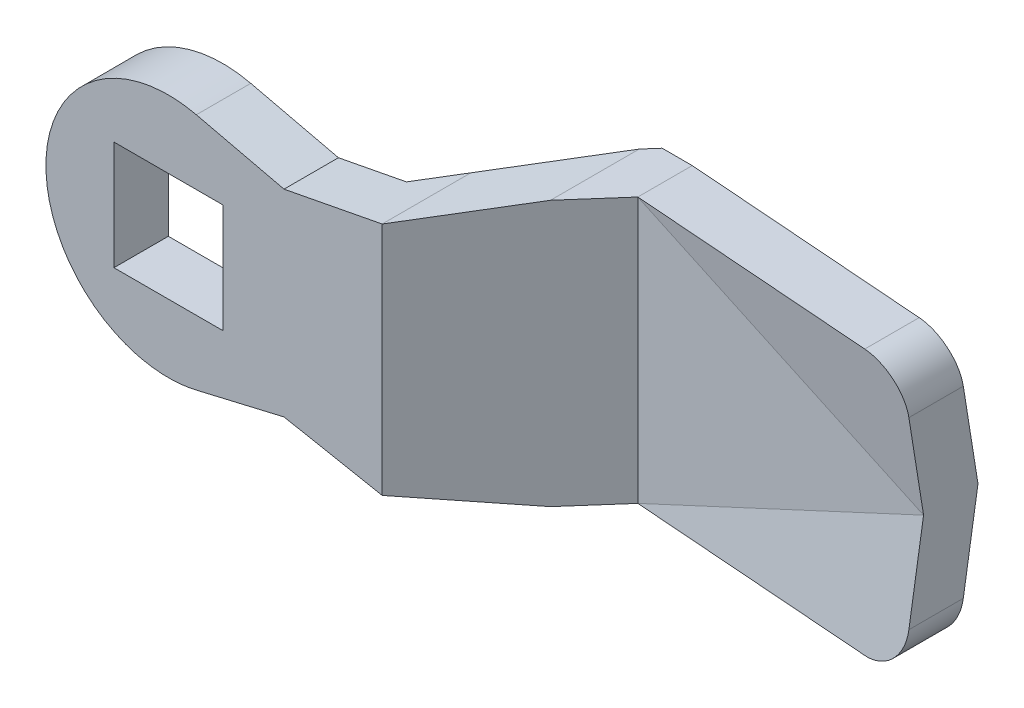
ISO-10303-21;
HEADER;
FILE_DESCRIPTION(('STEP AP214'),'2;1');
FILE_NAME('part.step','',(''),(''),'','','');
FILE_SCHEMA(('AUTOMOTIVE_DESIGN { 1 0 10303 214 1 1 1 1 }'));
ENDSEC;
DATA;
#1=APPLICATION_CONTEXT('core data for automotive mechanical design processes');
#2=APPLICATION_PROTOCOL_DEFINITION('international standard','automotive_design',2000,#1);
#3=PRODUCT_CONTEXT('',#1,'mechanical');
#4=PRODUCT('Part','Part','',(#3));
#5=PRODUCT_RELATED_PRODUCT_CATEGORY('part','',(#4));
#6=PRODUCT_DEFINITION_FORMATION('','',#4);
#7=PRODUCT_DEFINITION_CONTEXT('part definition',#1,'design');
#8=PRODUCT_DEFINITION('design','',#6,#7);
#9=PRODUCT_DEFINITION_SHAPE('','',#8);
#10=(LENGTH_UNIT() NAMED_UNIT(*) SI_UNIT(.MILLI.,.METRE.));
#11=(NAMED_UNIT(*) PLANE_ANGLE_UNIT() SI_UNIT($,.RADIAN.));
#12=(NAMED_UNIT(*) SI_UNIT($,.STERADIAN.) SOLID_ANGLE_UNIT());
#13=UNCERTAINTY_MEASURE_WITH_UNIT(LENGTH_MEASURE(1.E-05),#10,'distance_accuracy_value','');
#14=(GEOMETRIC_REPRESENTATION_CONTEXT(3) GLOBAL_UNCERTAINTY_ASSIGNED_CONTEXT((#13)) GLOBAL_UNIT_ASSIGNED_CONTEXT((#10,
#11,#12)) REPRESENTATION_CONTEXT('',''));
#15=CARTESIAN_POINT('',(0.,0.,0.));
#16=DIRECTION('',(0.,0.,1.));
#17=DIRECTION('',(1.,0.,0.));
#18=AXIS2_PLACEMENT_3D('',#15,#16,#17);
#19=CARTESIAN_POINT('',(9.,0.,-2.5));
#20=DIRECTION('',(0.,0.,1.));
#21=DIRECTION('',(1.,0.,0.));
#22=AXIS2_PLACEMENT_3D('',#19,#20,#21);
#23=PLANE('',#22);
#24=CARTESIAN_POINT('',(11.5,-3.,-2.5));
#25=DIRECTION('',(-1.,0.,0.));
#26=VECTOR('',#25,1.);
#27=LINE('',#24,#26);
#28=CARTESIAN_POINT('',(11.5,-3.,-2.5));
#29=VERTEX_POINT('',#28);
#30=CARTESIAN_POINT('',(6.5,-3.,-2.5));
#31=VERTEX_POINT('',#30);
#32=EDGE_CURVE('E841',#29,#31,#27,.T.);
#33=ORIENTED_EDGE('',*,*,#32,.T.);
#34=CARTESIAN_POINT('',(6.5,-3.,-2.5));
#35=DIRECTION('',(0.,1.,0.));
#36=VECTOR('',#35,1.);
#37=LINE('',#34,#36);
#38=CARTESIAN_POINT('',(6.5,3.,-2.5));
#39=VERTEX_POINT('',#38);
#40=EDGE_CURVE('E880',#31,#39,#37,.T.);
#41=ORIENTED_EDGE('',*,*,#40,.T.);
#42=CARTESIAN_POINT('',(6.5,3.,-2.5));
#43=DIRECTION('',(1.,0.,0.));
#44=VECTOR('',#43,1.);
#45=LINE('',#42,#44);
#46=CARTESIAN_POINT('',(11.5,3.,-2.5));
#47=VERTEX_POINT('',#46);
#48=EDGE_CURVE('E867',#39,#47,#45,.T.);
#49=ORIENTED_EDGE('',*,*,#48,.T.);
#50=CARTESIAN_POINT('',(11.5,3.,-2.5));
#51=DIRECTION('',(0.,-1.,0.));
#52=VECTOR('',#51,1.);
#53=LINE('',#50,#52);
#54=EDGE_CURVE('E854',#47,#29,#53,.T.);
#55=ORIENTED_EDGE('',*,*,#54,.T.);
#56=EDGE_LOOP('',(#33,#41,#49,#55));
#57=FACE_BOUND('',#56,.T.);
#58=ADVANCED_FACE('F16',(#57),#23,.F.);
#59=CARTESIAN_POINT('',(6.5,0.,-1.25));
#60=DIRECTION('',(1.,0.,0.));
#61=DIRECTION('',(0.,1.,0.));
#62=AXIS2_PLACEMENT_3D('',#59,#60,#61);
#63=PLANE('',#62);
#64=ORIENTED_EDGE('',*,*,#40,.F.);
#65=CARTESIAN_POINT('',(6.5,-3.,-2.5));
#66=DIRECTION('',(0.,0.,1.));
#67=VECTOR('',#66,1.);
#68=LINE('',#65,#67);
#69=CARTESIAN_POINT('',(6.5,-3.,0.));
#70=VERTEX_POINT('',#69);
#71=EDGE_CURVE('E835',#31,#70,#68,.T.);
#72=ORIENTED_EDGE('',*,*,#71,.T.);
#73=CARTESIAN_POINT('',(6.5,-3.,0.));
#74=DIRECTION('',(0.,1.,0.));
#75=VECTOR('',#74,1.);
#76=LINE('',#73,#75);
#77=CARTESIAN_POINT('',(6.5,3.,0.));
#78=VERTEX_POINT('',#77);
#79=EDGE_CURVE('E756',#70,#78,#76,.T.);
#80=ORIENTED_EDGE('',*,*,#79,.T.);
#81=CARTESIAN_POINT('',(6.5,3.,0.));
#82=DIRECTION('',(0.,0.,-1.));
#83=VECTOR('',#82,1.);
#84=LINE('',#81,#83);
#85=EDGE_CURVE('E873',#78,#39,#84,.T.);
#86=ORIENTED_EDGE('',*,*,#85,.T.);
#87=EDGE_LOOP('',(#64,#72,#80,#86));
#88=FACE_BOUND('',#87,.T.);
#89=ADVANCED_FACE('F1253',(#88),#63,.F.);
#90=CARTESIAN_POINT('',(9.,3.,-1.25));
#91=DIRECTION('',(0.,-1.,0.));
#92=DIRECTION('',(0.,0.,-1.));
#93=AXIS2_PLACEMENT_3D('',#90,#91,#92);
#94=PLANE('',#93);
#95=ORIENTED_EDGE('',*,*,#48,.F.);
#96=ORIENTED_EDGE('',*,*,#85,.F.);
#97=CARTESIAN_POINT('',(6.5,3.,0.));
#98=DIRECTION('',(1.,0.,0.));
#99=VECTOR('',#98,1.);
#100=LINE('',#97,#99);
#101=CARTESIAN_POINT('',(11.5,3.,0.));
#102=VERTEX_POINT('',#101);
#103=EDGE_CURVE('E750',#78,#102,#100,.T.);
#104=ORIENTED_EDGE('',*,*,#103,.T.);
#105=CARTESIAN_POINT('',(11.5,3.,0.));
#106=DIRECTION('',(0.,0.,-1.));
#107=VECTOR('',#106,1.);
#108=LINE('',#105,#107);
#109=EDGE_CURVE('E860',#102,#47,#108,.T.);
#110=ORIENTED_EDGE('',*,*,#109,.T.);
#111=EDGE_LOOP('',(#95,#96,#104,#110));
#112=FACE_BOUND('',#111,.T.);
#113=ADVANCED_FACE('F1241',(#112),#94,.F.);
#114=CARTESIAN_POINT('',(11.5,0.,-1.25));
#115=DIRECTION('',(-1.,0.,0.));
#116=DIRECTION('',(0.,0.,1.));
#117=AXIS2_PLACEMENT_3D('',#114,#115,#116);
#118=PLANE('',#117);
#119=ORIENTED_EDGE('',*,*,#54,.F.);
#120=ORIENTED_EDGE('',*,*,#109,.F.);
#121=CARTESIAN_POINT('',(11.5,3.,0.));
#122=DIRECTION('',(0.,-1.,0.));
#123=VECTOR('',#122,1.);
#124=LINE('',#121,#123);
#125=CARTESIAN_POINT('',(11.5,-3.,0.));
#126=VERTEX_POINT('',#125);
#127=EDGE_CURVE('E744',#102,#126,#124,.T.);
#128=ORIENTED_EDGE('',*,*,#127,.T.);
#129=CARTESIAN_POINT('',(11.5,-3.,0.));
#130=DIRECTION('',(0.,0.,-1.));
#131=VECTOR('',#130,1.);
#132=LINE('',#129,#131);
#133=EDGE_CURVE('E847',#126,#29,#132,.T.);
#134=ORIENTED_EDGE('',*,*,#133,.T.);
#135=EDGE_LOOP('',(#119,#120,#128,#134));
#136=FACE_BOUND('',#135,.T.);
#137=ADVANCED_FACE('F1229',(#136),#118,.F.);
#138=CARTESIAN_POINT('',(9.,-3.,-1.25));
#139=DIRECTION('',(0.,1.,0.));
#140=DIRECTION('',(1.,0.,0.));
#141=AXIS2_PLACEMENT_3D('',#138,#139,#140);
#142=PLANE('',#141);
#143=ORIENTED_EDGE('',*,*,#32,.F.);
#144=ORIENTED_EDGE('',*,*,#133,.F.);
#145=CARTESIAN_POINT('',(11.5,-3.,0.));
#146=DIRECTION('',(-1.,0.,0.));
#147=VECTOR('',#146,1.);
#148=LINE('',#145,#147);
#149=EDGE_CURVE('E737',#126,#70,#148,.T.);
#150=ORIENTED_EDGE('',*,*,#149,.T.);
#151=ORIENTED_EDGE('',*,*,#71,.F.);
#152=EDGE_LOOP('',(#143,#144,#150,#151));
#153=FACE_BOUND('',#152,.T.);
#154=ADVANCED_FACE('F1217',(#153),#142,.F.);
#155=CARTESIAN_POINT('',(5.277956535,8.006016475,0.));
#156=DIRECTION('',(0.22843478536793,0.973559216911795,0.));
#157=DIRECTION('',(0.,0.,-1.));
#158=AXIS2_PLACEMENT_3D('',#155,#156,#157);
#159=PLANE('',#158);
#160=CARTESIAN_POINT('',(8.5,7.25,0.));
#161=DIRECTION('',(-0.973559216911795,0.22843478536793,0.));
#162=VECTOR('',#161,1.);
#163=LINE('',#160,#162);
#164=CARTESIAN_POINT('',(8.5,7.25,0.));
#165=VERTEX_POINT('',#164);
#166=CARTESIAN_POINT('',(2.05591307,8.76203295,0.));
#167=VERTEX_POINT('',#166);
#168=EDGE_CURVE('E724',#165,#167,#163,.T.);
#169=ORIENTED_EDGE('',*,*,#168,.T.);
#170=CARTESIAN_POINT('',(2.05591307,8.76203295,4.));
#171=DIRECTION('',(0.,0.,-1.));
#172=VECTOR('',#171,1.);
#173=LINE('',#170,#172);
#174=CARTESIAN_POINT('',(2.05591307,8.76203295,4.));
#175=VERTEX_POINT('',#174);
#176=EDGE_CURVE('E828',#175,#167,#173,.T.);
#177=ORIENTED_EDGE('',*,*,#176,.F.);
#178=CARTESIAN_POINT('',(8.5,7.25,4.));
#179=DIRECTION('',(-0.973559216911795,0.22843478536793,0.));
#180=VECTOR('',#179,1.);
#181=LINE('',#178,#180);
#182=CARTESIAN_POINT('',(8.5,7.25,4.));
#183=VERTEX_POINT('',#182);
#184=EDGE_CURVE('E667',#183,#175,#181,.T.);
#185=ORIENTED_EDGE('',*,*,#184,.F.);
#186=CARTESIAN_POINT('',(8.5,7.25,0.));
#187=DIRECTION('',(0.,0.,1.));
#188=VECTOR('',#187,1.);
#189=LINE('',#186,#188);
#190=EDGE_CURVE('E788',#165,#183,#189,.T.);
#191=ORIENTED_EDGE('',*,*,#190,.F.);
#192=EDGE_LOOP('',(#169,#177,#185,#191));
#193=FACE_BOUND('',#192,.T.);
#194=ADVANCED_FACE('F1205',(#193),#159,.T.);
#195=CARTESIAN_POINT('',(-1.43440992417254E-09,0.,0.));
#196=DIRECTION('',(0.,0.,1.));
#197=DIRECTION('',(0.228434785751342,0.973559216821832,0.));
#198=AXIS2_PLACEMENT_3D('',#195,#196,#197);
#199=CYLINDRICAL_SURFACE('',#198,8.99999999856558);
#200=ORIENTED_EDGE('',*,*,#176,.T.);
#201=CARTESIAN_POINT('',(-1.43440992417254E-09,0.,0.));
#202=DIRECTION('',(0.,0.,1.));
#203=DIRECTION('',(0.228434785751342,0.973559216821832,0.));
#204=AXIS2_PLACEMENT_3D('',#201,#202,#203);
#205=CIRCLE('',#204,8.99999999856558);
#206=CARTESIAN_POINT('',(-2.05591307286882,-8.76203295,0.));
#207=VERTEX_POINT('',#206);
#208=EDGE_CURVE('E718',#167,#207,#205,.T.);
#209=ORIENTED_EDGE('',*,*,#208,.T.);
#210=CARTESIAN_POINT('',(-2.0559130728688,-8.76203295,4.));
#211=DIRECTION('',(0.,0.,-1.));
#212=VECTOR('',#211,1.);
#213=LINE('',#210,#212);
#214=CARTESIAN_POINT('',(-2.05591307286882,-8.76203295,4.));
#215=VERTEX_POINT('',#214);
#216=EDGE_CURVE('E821',#215,#207,#213,.T.);
#217=ORIENTED_EDGE('',*,*,#216,.F.);
#218=CARTESIAN_POINT('',(2.05591307,8.76203295,4.));
#219=CARTESIAN_POINT('',(1.1931985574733,8.96445926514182,4.));
#220=CARTESIAN_POINT('',(0.30702144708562,8.9947616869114,4.));
#221=CARTESIAN_POINT('',(-0.5783337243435,9.02503600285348,4.));
#222=CARTESIAN_POINT('',(-1.45366883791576,8.88182677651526,4.));
#223=CARTESIAN_POINT('',(-2.32791838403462,8.73879515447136,4.));
#224=CARTESIAN_POINT('',(-3.15849544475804,8.42756824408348,4.));
#225=CARTESIAN_POINT('',(-3.98804244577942,8.11672730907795,4.));
#226=CARTESIAN_POINT('',(-4.74194284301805,7.6494429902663,4.));
#227=CARTESIAN_POINT('',(-5.49490827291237,7.1827381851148,4.));
#228=CARTESIAN_POINT('',(-6.14316003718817,6.57735393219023,4.));
#229=CARTESIAN_POINT('',(-6.79060785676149,5.97272046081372,4.));
#230=CARTESIAN_POINT('',(-7.30829903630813,5.25250085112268,4.));
#231=CARTESIAN_POINT('',(-7.82534818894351,4.53317443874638,4.));
#232=CARTESIAN_POINT('',(-8.19258420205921,3.72579710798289,4.));
#233=CARTESIAN_POINT('',(-8.55936477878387,2.91942106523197,4.));
#234=CARTESIAN_POINT('',(-8.76203295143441,2.05591307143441,4.));
#235=CARTESIAN_POINT('',(-8.96444978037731,1.19347597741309,4.));
#236=CARTESIAN_POINT('',(-8.99476168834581,0.307021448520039,4.));
#237=CARTESIAN_POINT('',(-9.02503600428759,-0.578333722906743,4.));
#238=CARTESIAN_POINT('',(-8.88182677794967,-1.45366883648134,4.));
#239=CARTESIAN_POINT('',(-8.73879515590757,-2.32791838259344,4.));
#240=CARTESIAN_POINT('',(-8.42756824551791,-3.15849544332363,4.));
#241=CARTESIAN_POINT('',(-8.11672731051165,-3.98804244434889,4.));
#242=CARTESIAN_POINT('',(-7.64944299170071,-4.74194284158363,4.));
#243=CARTESIAN_POINT('',(-7.18273818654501,-5.494908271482,4.));
#244=CARTESIAN_POINT('',(-6.57735393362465,-6.14316003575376,4.));
#245=CARTESIAN_POINT('',(-5.97272046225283,-6.7906078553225,4.));
#246=CARTESIAN_POINT('',(-5.25250085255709,-7.30829903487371,4.));
#247=CARTESIAN_POINT('',(-4.53317444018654,-7.82534818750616,4.));
#248=CARTESIAN_POINT('',(-3.7257971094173,-8.19258420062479,4.));
#249=CARTESIAN_POINT('',(-2.91916823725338,-8.55947977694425,4.));
#250=CARTESIAN_POINT('',(-2.05591307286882,-8.76203295,4.));
#251=B_SPLINE_CURVE_WITH_KNOTS('',2,(#218,#219,#220,#221,#222,#223,#224,#225,#226,#227,#228,
#229,#230,#231,#232,#233,#234,#235,#236,#237,#238,#239,#240,#241,#242,#243,#244,#245,#246,#247,
#248,#249,#250),.UNSPECIFIED.,.F.,.F.,(3,2,2,2,2,2,2,2,2,2,2,2,2,2,2,2,3),(0.,0.0625,0.125,
0.1875,0.25,0.3125,0.375,0.4375,0.5,0.5625,0.625,0.6875,0.75,0.8125,0.875,0.9375,1.),.UNSPECIFIED.);
#252=EDGE_CURVE('E660',#175,#215,#251,.T.);
#253=ORIENTED_EDGE('',*,*,#252,.F.);
#254=EDGE_LOOP('',(#200,#209,#217,#253));
#255=FACE_BOUND('',#254,.T.);
#256=ADVANCED_FACE('F1193',(#255),#199,.T.);
#257=CARTESIAN_POINT('',(-1.43440992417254E-09,0.,0.));
#258=DIRECTION('',(0.,0.,1.));
#259=DIRECTION('',(0.228434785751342,0.973559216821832,0.));
#260=AXIS2_PLACEMENT_3D('',#257,#258,#259);
#261=CYLINDRICAL_SURFACE('',#260,8.99999999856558);
#262=CARTESIAN_POINT('',(2.05591307,-8.76203294,4.));
#263=DIRECTION('',(0.,0.,-1.));
#264=VECTOR('',#263,1.);
#265=LINE('',#262,#264);
#266=CARTESIAN_POINT('',(2.05591307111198,-8.76203294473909,4.));
#267=VERTEX_POINT('',#266);
#268=CARTESIAN_POINT('',(2.05591307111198,-8.76203294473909,0.));
#269=VERTEX_POINT('',#268);
#270=EDGE_CURVE('E705',#267,#269,#265,.T.);
#271=ORIENTED_EDGE('',*,*,#270,.F.);
#272=CARTESIAN_POINT('',(-2.05591307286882,-8.76203295,4.));
#273=CARTESIAN_POINT('',(-1.04199998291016,-8.99993632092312,4.));
#274=CARTESIAN_POINT('',(-2.92240190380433E-10,-8.99999999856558,4.));
#275=CARTESIAN_POINT('',(1.04145735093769,-9.00006364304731,4.));
#276=CARTESIAN_POINT('',(2.05591307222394,-8.76203294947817,4.));
#277=B_SPLINE_CURVE_WITH_KNOTS('',2,(#272,#273,#274,#275,#276),.UNSPECIFIED.,.F.,.F.,(3,2,3),
(0.,0.5,1.),.UNSPECIFIED.);
#278=EDGE_CURVE('E653',#215,#267,#277,.T.);
#279=ORIENTED_EDGE('',*,*,#278,.F.);
#280=ORIENTED_EDGE('',*,*,#216,.T.);
#281=CARTESIAN_POINT('',(-1.43440992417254E-09,0.,0.));
#282=DIRECTION('',(0.,0.,1.));
#283=DIRECTION('',(-0.22843478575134,-0.973559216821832,0.));
#284=AXIS2_PLACEMENT_3D('',#281,#282,#283);
#285=CIRCLE('',#284,8.99999999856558);
#286=EDGE_CURVE('E712',#207,#269,#285,.T.);
#287=ORIENTED_EDGE('',*,*,#286,.T.);
#288=EDGE_LOOP('',(#271,#279,#280,#287));
#289=FACE_BOUND('',#288,.T.);
#290=ADVANCED_FACE('F1181',(#289),#261,.T.);
#291=CARTESIAN_POINT('',(0.,-4.,3.));
#292=DIRECTION('',(0.,1.,0.));
#293=DIRECTION('',(1.,0.,0.));
#294=AXIS2_PLACEMENT_3D('',#291,#292,#293);
#295=PLANE('',#294);
#296=CARTESIAN_POINT('',(4.,-4.,4.));
#297=DIRECTION('',(-1.,0.,0.));
#298=VECTOR('',#297,1.);
#299=LINE('',#296,#298);
#300=CARTESIAN_POINT('',(4.,-4.,4.));
#301=VERTEX_POINT('',#300);
#302=CARTESIAN_POINT('',(-4.,-4.,4.));
#303=VERTEX_POINT('',#302);
#304=EDGE_CURVE('E640',#301,#303,#299,.T.);
#305=ORIENTED_EDGE('',*,*,#304,.F.);
#306=CARTESIAN_POINT('',(4.,-4.,0.));
#307=DIRECTION('',(0.,0.,1.));
#308=VECTOR('',#307,1.);
#309=LINE('',#306,#308);
#310=CARTESIAN_POINT('',(4.,-4.,0.));
#311=VERTEX_POINT('',#310);
#312=EDGE_CURVE('E801',#311,#301,#309,.T.);
#313=ORIENTED_EDGE('',*,*,#312,.F.);
#314=CARTESIAN_POINT('',(4.,-4.,0.));
#315=DIRECTION('',(-1.,0.,0.));
#316=VECTOR('',#315,1.);
#317=LINE('',#314,#316);
#318=CARTESIAN_POINT('',(-4.,-4.,0.));
#319=VERTEX_POINT('',#318);
#320=EDGE_CURVE('E762',#311,#319,#317,.T.);
#321=ORIENTED_EDGE('',*,*,#320,.T.);
#322=CARTESIAN_POINT('',(-4.,-4.,4.));
#323=DIRECTION('',(0.,0.,-1.));
#324=VECTOR('',#323,1.);
#325=LINE('',#322,#324);
#326=EDGE_CURVE('E815',#303,#319,#325,.T.);
#327=ORIENTED_EDGE('',*,*,#326,.F.);
#328=EDGE_LOOP('',(#305,#313,#321,#327));
#329=FACE_BOUND('',#328,.T.);
#330=ADVANCED_FACE('F1169',(#329),#295,.T.);
#331=CARTESIAN_POINT('',(-4.,0.,3.));
#332=DIRECTION('',(1.,0.,0.));
#333=DIRECTION('',(0.,1.,0.));
#334=AXIS2_PLACEMENT_3D('',#331,#332,#333);
#335=PLANE('',#334);
#336=CARTESIAN_POINT('',(-4.,-4.,4.));
#337=DIRECTION('',(0.,1.,0.));
#338=VECTOR('',#337,1.);
#339=LINE('',#336,#338);
#340=CARTESIAN_POINT('',(-4.,4.,4.));
#341=VERTEX_POINT('',#340);
#342=EDGE_CURVE('E633',#303,#341,#339,.T.);
#343=ORIENTED_EDGE('',*,*,#342,.F.);
#344=ORIENTED_EDGE('',*,*,#326,.T.);
#345=CARTESIAN_POINT('',(-4.,-4.,0.));
#346=DIRECTION('',(0.,1.,0.));
#347=VECTOR('',#346,1.);
#348=LINE('',#345,#347);
#349=CARTESIAN_POINT('',(-4.,4.,0.));
#350=VERTEX_POINT('',#349);
#351=EDGE_CURVE('E782',#319,#350,#348,.T.);
#352=ORIENTED_EDGE('',*,*,#351,.T.);
#353=CARTESIAN_POINT('',(-4.,4.,4.));
#354=DIRECTION('',(0.,0.,-1.));
#355=VECTOR('',#354,1.);
#356=LINE('',#353,#355);
#357=EDGE_CURVE('E808',#341,#350,#356,.T.);
#358=ORIENTED_EDGE('',*,*,#357,.F.);
#359=EDGE_LOOP('',(#343,#344,#352,#358));
#360=FACE_BOUND('',#359,.T.);
#361=ADVANCED_FACE('F1157',(#360),#335,.T.);
#362=CARTESIAN_POINT('',(0.,4.,3.));
#363=DIRECTION('',(0.,-1.,0.));
#364=DIRECTION('',(0.,0.,-1.));
#365=AXIS2_PLACEMENT_3D('',#362,#363,#364);
#366=PLANE('',#365);
#367=CARTESIAN_POINT('',(-4.,4.,4.));
#368=DIRECTION('',(1.,0.,0.));
#369=VECTOR('',#368,1.);
#370=LINE('',#367,#369);
#371=CARTESIAN_POINT('',(4.,4.,4.));
#372=VERTEX_POINT('',#371);
#373=EDGE_CURVE('E626',#341,#372,#370,.T.);
#374=ORIENTED_EDGE('',*,*,#373,.F.);
#375=ORIENTED_EDGE('',*,*,#357,.T.);
#376=CARTESIAN_POINT('',(-4.,4.,0.));
#377=DIRECTION('',(1.,0.,0.));
#378=VECTOR('',#377,1.);
#379=LINE('',#376,#378);
#380=CARTESIAN_POINT('',(4.,4.,0.));
#381=VERTEX_POINT('',#380);
#382=EDGE_CURVE('E776',#350,#381,#379,.T.);
#383=ORIENTED_EDGE('',*,*,#382,.T.);
#384=CARTESIAN_POINT('',(4.,4.,4.));
#385=DIRECTION('',(0.,0.,-1.));
#386=VECTOR('',#385,1.);
#387=LINE('',#384,#386);
#388=EDGE_CURVE('E794',#372,#381,#387,.T.);
#389=ORIENTED_EDGE('',*,*,#388,.F.);
#390=EDGE_LOOP('',(#374,#375,#383,#389));
#391=FACE_BOUND('',#390,.T.);
#392=ADVANCED_FACE('F1145',(#391),#366,.T.);
#393=CARTESIAN_POINT('',(4.,0.,3.));
#394=DIRECTION('',(-1.,0.,0.));
#395=DIRECTION('',(0.,0.,1.));
#396=AXIS2_PLACEMENT_3D('',#393,#394,#395);
#397=PLANE('',#396);
#398=CARTESIAN_POINT('',(4.,4.,4.));
#399=DIRECTION('',(0.,-1.,0.));
#400=VECTOR('',#399,1.);
#401=LINE('',#398,#400);
#402=EDGE_CURVE('E221',#372,#301,#401,.T.);
#403=ORIENTED_EDGE('',*,*,#402,.F.);
#404=ORIENTED_EDGE('',*,*,#388,.T.);
#405=CARTESIAN_POINT('',(4.,4.,0.));
#406=DIRECTION('',(0.,-1.,0.));
#407=VECTOR('',#406,1.);
#408=LINE('',#405,#407);
#409=EDGE_CURVE('E769',#381,#311,#408,.T.);
#410=ORIENTED_EDGE('',*,*,#409,.T.);
#411=ORIENTED_EDGE('',*,*,#312,.T.);
#412=EDGE_LOOP('',(#403,#404,#410,#411));
#413=FACE_BOUND('',#412,.T.);
#414=ADVANCED_FACE('F1133',(#413),#397,.T.);
#415=CARTESIAN_POINT('',(12.105940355,7.94345007,0.));
#416=DIRECTION('',(-0.188847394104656,0.982006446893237,0.));
#417=DIRECTION('',(0.,0.,1.));
#418=AXIS2_PLACEMENT_3D('',#415,#416,#417);
#419=PLANE('',#418);
#420=CARTESIAN_POINT('',(13.5,8.21153846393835,0.));
#421=DIRECTION('',(-0.982006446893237,-0.188847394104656,0.));
#422=VECTOR('',#421,1.);
#423=LINE('',#420,#422);
#424=CARTESIAN_POINT('',(13.5,8.21153846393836,0.));
#425=VERTEX_POINT('',#424);
#426=EDGE_CURVE('E730',#425,#165,#423,.T.);
#427=ORIENTED_EDGE('',*,*,#426,.T.);
#428=ORIENTED_EDGE('',*,*,#190,.T.);
#429=CARTESIAN_POINT('',(15.71188071,8.63690014,4.));
#430=DIRECTION('',(-0.982006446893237,-0.188847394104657,0.));
#431=VECTOR('',#430,1.);
#432=LINE('',#429,#431);
#433=CARTESIAN_POINT('',(15.71188071,8.63690014,4.));
#434=VERTEX_POINT('',#433);
#435=EDGE_CURVE('E674',#434,#183,#432,.T.);
#436=ORIENTED_EDGE('',*,*,#435,.F.);
#437=CARTESIAN_POINT('',(15.71188071,8.63690014,4.));
#438=DIRECTION('',(0.,0.,-1.));
#439=VECTOR('',#438,1.);
#440=LINE('',#437,#439);
#441=CARTESIAN_POINT('',(15.71188071,8.63690014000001,-2.5168988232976));
#442=VERTEX_POINT('',#441);
#443=EDGE_CURVE('E681',#434,#442,#440,.T.);
#444=ORIENTED_EDGE('',*,*,#443,.T.);
#445=CARTESIAN_POINT('',(13.5,8.21153846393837,0.));
#446=DIRECTION('',(0.654869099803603,0.125936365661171,-0.745175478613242));
#447=VECTOR('',#446,1.);
#448=LINE('',#445,#447);
#449=EDGE_CURVE('E597',#425,#442,#448,.T.);
#450=ORIENTED_EDGE('',*,*,#449,.F.);
#451=EDGE_LOOP('',(#427,#428,#436,#444,#450));
#452=FACE_BOUND('',#451,.T.);
#453=ADVANCED_FACE('F1122',(#452),#419,.T.);
#454=CARTESIAN_POINT('',(23.394059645,15.,-10.));
#455=DIRECTION('',(0.,0.,-1.));
#456=DIRECTION('',(0.,-1.,0.));
#457=AXIS2_PLACEMENT_3D('',#454,#455,#456);
#458=PLANE('',#457);
#459=CARTESIAN_POINT('',(22.28811929,9.75,-10.));
#460=DIRECTION('',(1.,0.,0.));
#461=VECTOR('',#460,1.);
#462=LINE('',#459,#461);
#463=CARTESIAN_POINT('',(22.28811929,9.75,-10.));
#464=VERTEX_POINT('',#463);
#465=CARTESIAN_POINT('',(24.5,9.75,-10.));
#466=VERTEX_POINT('',#465);
#467=EDGE_CURVE('E198',#464,#466,#462,.T.);
#468=ORIENTED_EDGE('',*,*,#467,.T.);
#469=CARTESIAN_POINT('',(24.5,9.75,-10.));
#470=DIRECTION('',(0.,-1.,0.));
#471=VECTOR('',#470,1.);
#472=LINE('',#469,#471);
#473=CARTESIAN_POINT('',(24.5,-9.75,-10.));
#474=VERTEX_POINT('',#473);
#475=EDGE_CURVE('E190',#466,#474,#472,.T.);
#476=ORIENTED_EDGE('',*,*,#475,.T.);
#477=CARTESIAN_POINT('',(24.5,-9.75,-10.));
#478=DIRECTION('',(-1.,0.,0.));
#479=VECTOR('',#478,1.);
#480=LINE('',#477,#479);
#481=CARTESIAN_POINT('',(22.28811929,-9.75,-10.));
#482=VERTEX_POINT('',#481);
#483=EDGE_CURVE('E195',#474,#482,#480,.T.);
#484=ORIENTED_EDGE('',*,*,#483,.T.);
#485=CARTESIAN_POINT('',(22.28811929,9.75,-10.));
#486=DIRECTION('',(0.,-1.,0.));
#487=VECTOR('',#486,1.);
#488=LINE('',#485,#487);
#489=EDGE_CURVE('E577',#464,#482,#488,.T.);
#490=ORIENTED_EDGE('',*,*,#489,.F.);
#491=EDGE_LOOP('',(#468,#476,#484,#490));
#492=FACE_BOUND('',#491,.T.);
#493=ADVANCED_FACE('F193',(#492),#458,.T.);
#494=CARTESIAN_POINT('',(4.93826795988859,2.68955109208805E-09,0.));
#495=DIRECTION('',(0.,0.,1.));
#496=DIRECTION('',(1.,0.,0.));
#497=AXIS2_PLACEMENT_3D('',#494,#495,#496);
#498=PLANE('',#497);
#499=CARTESIAN_POINT('',(8.5,-7.24999999,0.));
#500=DIRECTION('',(0.982006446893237,-0.188847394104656,0.));
#501=VECTOR('',#500,1.);
#502=LINE('',#499,#501);
#503=CARTESIAN_POINT('',(8.5,-7.24999999,0.));
#504=VERTEX_POINT('',#503);
#505=CARTESIAN_POINT('',(13.5000000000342,-8.21153845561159,3.12814733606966E-10));
#506=VERTEX_POINT('',#505);
#507=EDGE_CURVE('E570',#504,#506,#502,.T.);
#508=ORIENTED_EDGE('',*,*,#507,.F.);
#509=CARTESIAN_POINT('',(2.05591307,-8.76203294,0.));
#510=DIRECTION('',(0.973559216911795,0.22843478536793,0.));
#511=VECTOR('',#510,1.);
#512=LINE('',#509,#511);
#513=EDGE_CURVE('E698',#269,#504,#512,.T.);
#514=ORIENTED_EDGE('',*,*,#513,.F.);
#515=ORIENTED_EDGE('',*,*,#286,.F.);
#516=ORIENTED_EDGE('',*,*,#208,.F.);
#517=ORIENTED_EDGE('',*,*,#168,.F.);
#518=ORIENTED_EDGE('',*,*,#426,.F.);
#519=CARTESIAN_POINT('',(13.5,-8.21153845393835,0.));
#520=DIRECTION('',(0.,1.,0.));
#521=VECTOR('',#520,1.);
#522=LINE('',#519,#521);
#523=EDGE_CURVE('E604',#506,#425,#522,.T.);
#524=ORIENTED_EDGE('',*,*,#523,.F.);
#525=EDGE_LOOP('',(#508,#514,#515,#516,#517,#518,#524));
#526=FACE_BOUND('',#525,.T.);
#527=ORIENTED_EDGE('',*,*,#127,.F.);
#528=ORIENTED_EDGE('',*,*,#103,.F.);
#529=ORIENTED_EDGE('',*,*,#79,.F.);
#530=ORIENTED_EDGE('',*,*,#149,.F.);
#531=EDGE_LOOP('',(#527,#528,#529,#530));
#532=FACE_BOUND('',#531,.T.);
#533=ORIENTED_EDGE('',*,*,#409,.F.);
#534=ORIENTED_EDGE('',*,*,#382,.F.);
#535=ORIENTED_EDGE('',*,*,#351,.F.);
#536=ORIENTED_EDGE('',*,*,#320,.F.);
#537=EDGE_LOOP('',(#533,#534,#535,#536));
#538=FACE_BOUND('',#537,.T.);
#539=ADVANCED_FACE('F1099',(#526,#532,#538),#498,.F.);
#540=CARTESIAN_POINT('',(5.277956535,-8.006016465,0.));
#541=DIRECTION('',(0.22843478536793,-0.973559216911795,0.));
#542=DIRECTION('',(0.,0.,-1.));
#543=AXIS2_PLACEMENT_3D('',#540,#541,#542);
#544=PLANE('',#543);
#545=ORIENTED_EDGE('',*,*,#513,.T.);
#546=CARTESIAN_POINT('',(8.5,-7.24999999,4.));
#547=DIRECTION('',(0.,0.,-1.));
#548=VECTOR('',#547,1.);
#549=LINE('',#546,#548);
#550=CARTESIAN_POINT('',(8.5,-7.24999999,4.));
#551=VERTEX_POINT('',#550);
#552=EDGE_CURVE('E549',#551,#504,#549,.T.);
#553=ORIENTED_EDGE('',*,*,#552,.F.);
#554=CARTESIAN_POINT('',(2.05591307,-8.76203294,4.));
#555=DIRECTION('',(0.973559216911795,0.228434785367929,0.));
#556=VECTOR('',#555,1.);
#557=LINE('',#554,#556);
#558=EDGE_CURVE('E647',#267,#551,#557,.T.);
#559=ORIENTED_EDGE('',*,*,#558,.F.);
#560=ORIENTED_EDGE('',*,*,#270,.T.);
#561=EDGE_LOOP('',(#545,#553,#559,#560));
#562=FACE_BOUND('',#561,.T.);
#563=ADVANCED_FACE('F1087',(#562),#544,.T.);
#564=CARTESIAN_POINT('',(24.5,9.75,-30.));
#565=DIRECTION('',(0.,-1.,0.));
#566=DIRECTION('',(0.,0.,-1.));
#567=AXIS2_PLACEMENT_3D('',#564,#565,#566);
#568=PLANE('',#567);
#569=CARTESIAN_POINT('',(21.5,9.75,-9.10319914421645));
#570=DIRECTION('',(0.,0.,1.));
#571=VECTOR('',#570,1.);
#572=LINE('',#569,#571);
#573=CARTESIAN_POINT('',(21.5,9.75,-9.10319914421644));
#574=VERTEX_POINT('',#573);
#575=CARTESIAN_POINT('',(21.5,9.75,-2.58630032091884));
#576=VERTEX_POINT('',#575);
#577=EDGE_CURVE('E687',#574,#576,#572,.T.);
#578=ORIENTED_EDGE('',*,*,#577,.T.);
#579=CARTESIAN_POINT('',(24.5,9.75,-6.00000000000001));
#580=DIRECTION('',(-0.660124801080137,0.,0.751155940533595));
#581=VECTOR('',#580,1.);
#582=LINE('',#579,#581);
#583=CARTESIAN_POINT('',(24.5,9.75,-6.));
#584=VERTEX_POINT('',#583);
#585=EDGE_CURVE('E536',#584,#576,#582,.T.);
#586=ORIENTED_EDGE('',*,*,#585,.F.);
#587=CARTESIAN_POINT('',(24.5,9.75,-10.));
#588=DIRECTION('',(0.,0.,1.));
#589=VECTOR('',#588,1.);
#590=LINE('',#587,#589);
#591=EDGE_CURVE('E899',#466,#584,#590,.T.);
#592=ORIENTED_EDGE('',*,*,#591,.F.);
#593=ORIENTED_EDGE('',*,*,#467,.F.);
#594=CARTESIAN_POINT('',(21.5,9.75,-9.10319914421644));
#595=DIRECTION('',(0.660124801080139,0.,-0.751155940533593));
#596=VECTOR('',#595,1.);
#597=LINE('',#594,#596);
#598=EDGE_CURVE('E583',#574,#464,#597,.T.);
#599=ORIENTED_EDGE('',*,*,#598,.F.);
#600=EDGE_LOOP('',(#578,#586,#592,#593,#599));
#601=FACE_BOUND('',#600,.T.);
#602=ADVANCED_FACE('F1075',(#601),#568,.F.);
#603=CARTESIAN_POINT('',(18.605940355,9.19345007,-30.));
#604=DIRECTION('',(0.188847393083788,-0.982006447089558,0.));
#605=DIRECTION('',(0.,0.,-1.));
#606=AXIS2_PLACEMENT_3D('',#603,#604,#605);
#607=PLANE('',#606);
#608=ORIENTED_EDGE('',*,*,#443,.F.);
#609=CARTESIAN_POINT('',(21.5,9.75,-2.58630032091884));
#610=DIRECTION('',(-0.654869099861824,-0.125936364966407,0.745175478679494));
#611=VECTOR('',#610,1.);
#612=LINE('',#609,#611);
#613=EDGE_CURVE('E529',#576,#434,#612,.T.);
#614=ORIENTED_EDGE('',*,*,#613,.F.);
#615=ORIENTED_EDGE('',*,*,#577,.F.);
#616=CARTESIAN_POINT('',(15.71188071,8.63690013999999,-2.51689882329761));
#617=DIRECTION('',(0.654869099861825,0.125936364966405,-0.745175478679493));
#618=VECTOR('',#617,1.);
#619=LINE('',#616,#618);
#620=EDGE_CURVE('E590',#442,#574,#619,.T.);
#621=ORIENTED_EDGE('',*,*,#620,.F.);
#622=EDGE_LOOP('',(#608,#614,#615,#621));
#623=FACE_BOUND('',#622,.T.);
#624=ADVANCED_FACE('F1063',(#623),#607,.F.);
#625=CARTESIAN_POINT('',(4.93826795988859,2.68955124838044E-09,4.));
#626=DIRECTION('',(0.,0.,1.));
#627=DIRECTION('',(1.,0.,0.));
#628=AXIS2_PLACEMENT_3D('',#625,#626,#627);
#629=PLANE('',#628);
#630=ORIENTED_EDGE('',*,*,#373,.T.);
#631=ORIENTED_EDGE('',*,*,#402,.T.);
#632=ORIENTED_EDGE('',*,*,#304,.T.);
#633=ORIENTED_EDGE('',*,*,#342,.T.);
#634=EDGE_LOOP('',(#630,#631,#632,#633));
#635=FACE_BOUND('',#634,.T.);
#636=ORIENTED_EDGE('',*,*,#278,.T.);
#637=ORIENTED_EDGE('',*,*,#558,.T.);
#638=CARTESIAN_POINT('',(15.7118807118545,-8.63690013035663,4.));
#639=DIRECTION('',(-0.982006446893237,0.188847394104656,0.));
#640=VECTOR('',#639,1.);
#641=LINE('',#638,#640);
#642=CARTESIAN_POINT('',(15.7118807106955,-8.63690013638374,4.));
#643=VERTEX_POINT('',#642);
#644=EDGE_CURVE('E556',#643,#551,#641,.T.);
#645=ORIENTED_EDGE('',*,*,#644,.F.);
#646=CARTESIAN_POINT('',(15.71188071,8.63690014,4.00000000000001));
#647=DIRECTION('',(0.,-1.,0.));
#648=VECTOR('',#647,1.);
#649=LINE('',#646,#648);
#650=EDGE_CURVE('E522',#434,#643,#649,.T.);
#651=ORIENTED_EDGE('',*,*,#650,.F.);
#652=ORIENTED_EDGE('',*,*,#435,.T.);
#653=ORIENTED_EDGE('',*,*,#184,.T.);
#654=ORIENTED_EDGE('',*,*,#252,.T.);
#655=EDGE_LOOP('',(#636,#637,#645,#651,#652,#653,#654));
#656=FACE_BOUND('',#655,.T.);
#657=ADVANCED_FACE('F1052',(#635,#656),#629,.T.);
#658=CARTESIAN_POINT('',(24.5,-9.75,-30.));
#659=DIRECTION('',(0.,1.,0.));
#660=DIRECTION('',(1.,0.,0.));
#661=AXIS2_PLACEMENT_3D('',#658,#659,#660);
#662=PLANE('',#661);
#663=CARTESIAN_POINT('',(21.5,-9.75,-2.58630032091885));
#664=DIRECTION('',(0.,0.,-1.));
#665=VECTOR('',#664,1.);
#666=LINE('',#663,#665);
#667=CARTESIAN_POINT('',(21.5,-9.75,-2.58630032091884));
#668=VERTEX_POINT('',#667);
#669=CARTESIAN_POINT('',(21.5,-9.75,-9.10319914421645));
#670=VERTEX_POINT('',#669);
#671=EDGE_CURVE('E516',#668,#670,#666,.T.);
#672=ORIENTED_EDGE('',*,*,#671,.T.);
#673=CARTESIAN_POINT('',(22.28811929,-9.74999999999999,-10.));
#674=DIRECTION('',(-0.660124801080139,0.,0.751155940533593));
#675=VECTOR('',#674,1.);
#676=LINE('',#673,#675);
#677=EDGE_CURVE('E217',#482,#670,#676,.T.);
#678=ORIENTED_EDGE('',*,*,#677,.F.);
#679=ORIENTED_EDGE('',*,*,#483,.F.);
#680=CARTESIAN_POINT('',(24.5,-9.75,-6.));
#681=DIRECTION('',(0.,0.,-1.));
#682=VECTOR('',#681,1.);
#683=LINE('',#680,#682);
#684=CARTESIAN_POINT('',(24.5,-9.75,-6.));
#685=VERTEX_POINT('',#684);
#686=EDGE_CURVE('E206',#685,#474,#683,.T.);
#687=ORIENTED_EDGE('',*,*,#686,.F.);
#688=CARTESIAN_POINT('',(21.5,-9.75,-2.58630032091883));
#689=DIRECTION('',(0.660124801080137,0.,-0.751155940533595));
#690=VECTOR('',#689,1.);
#691=LINE('',#688,#690);
#692=EDGE_CURVE('E543',#668,#685,#691,.T.);
#693=ORIENTED_EDGE('',*,*,#692,.F.);
#694=EDGE_LOOP('',(#672,#678,#679,#687,#693));
#695=FACE_BOUND('',#694,.T.);
#696=ADVANCED_FACE('F212',(#695),#662,.F.);
#697=CARTESIAN_POINT('',(17.894059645,15.,-5.));
#698=DIRECTION('',(-0.751155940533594,0.,-0.660124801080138));
#699=DIRECTION('',(-0.660124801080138,0.,0.751155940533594));
#700=AXIS2_PLACEMENT_3D('',#697,#698,#699);
#701=PLANE('',#700);
#702=ORIENTED_EDGE('',*,*,#598,.T.);
#703=ORIENTED_EDGE('',*,*,#489,.T.);
#704=ORIENTED_EDGE('',*,*,#677,.T.);
#705=CARTESIAN_POINT('',(21.5,-9.74999999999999,-9.10319914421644));
#706=DIRECTION('',(-0.654869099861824,0.12593636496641,0.745175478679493));
#707=VECTOR('',#706,1.);
#708=LINE('',#705,#707);
#709=CARTESIAN_POINT('',(15.7118807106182,-8.63690013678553,-2.51689882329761));
#710=VERTEX_POINT('',#709);
#711=EDGE_CURVE('E510',#670,#710,#708,.T.);
#712=ORIENTED_EDGE('',*,*,#711,.T.);
#713=CARTESIAN_POINT('',(13.5000000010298,-8.21153845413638,9.38450706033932E-10));
#714=DIRECTION('',(0.654869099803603,-0.12593636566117,-0.745175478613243));
#715=VECTOR('',#714,1.);
#716=LINE('',#713,#715);
#717=EDGE_CURVE('E563',#506,#710,#716,.T.);
#718=ORIENTED_EDGE('',*,*,#717,.F.);
#719=ORIENTED_EDGE('',*,*,#523,.T.);
#720=ORIENTED_EDGE('',*,*,#449,.T.);
#721=ORIENTED_EDGE('',*,*,#620,.T.);
#722=EDGE_LOOP('',(#702,#703,#704,#712,#718,#719,#720,#721));
#723=FACE_BOUND('',#722,.T.);
#724=ADVANCED_FACE('F1029',(#723),#701,.T.);
#725=CARTESIAN_POINT('',(12.105940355,-7.94345006,0.));
#726=DIRECTION('',(-0.188847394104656,-0.982006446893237,0.));
#727=DIRECTION('',(-0.982006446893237,0.188847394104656,0.));
#728=AXIS2_PLACEMENT_3D('',#725,#726,#727);
#729=PLANE('',#728);
#730=ORIENTED_EDGE('',*,*,#644,.T.);
#731=ORIENTED_EDGE('',*,*,#552,.T.);
#732=ORIENTED_EDGE('',*,*,#507,.T.);
#733=ORIENTED_EDGE('',*,*,#717,.T.);
#734=CARTESIAN_POINT('',(15.7118807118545,-8.63690013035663,-2.5168988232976));
#735=DIRECTION('',(0.,0.,1.));
#736=VECTOR('',#735,1.);
#737=LINE('',#734,#736);
#738=EDGE_CURVE('E503',#710,#643,#737,.T.);
#739=ORIENTED_EDGE('',*,*,#738,.T.);
#740=EDGE_LOOP('',(#730,#731,#732,#733,#739));
#741=FACE_BOUND('',#740,.T.);
#742=ADVANCED_FACE('F1017',(#741),#729,.T.);
#743=CARTESIAN_POINT('',(20.105940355,15.,-1.));
#744=DIRECTION('',(0.751155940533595,0.,0.660124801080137));
#745=DIRECTION('',(0.,-1.,0.));
#746=AXIS2_PLACEMENT_3D('',#743,#744,#745);
#747=PLANE('',#746);
#748=ORIENTED_EDGE('',*,*,#650,.T.);
#749=CARTESIAN_POINT('',(15.71188071,-8.63690014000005,4.00000000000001));
#750=DIRECTION('',(0.654869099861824,-0.125936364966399,-0.745175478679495));
#751=VECTOR('',#750,1.);
#752=LINE('',#749,#751);
#753=EDGE_CURVE('E252',#643,#668,#752,.T.);
#754=ORIENTED_EDGE('',*,*,#753,.T.);
#755=ORIENTED_EDGE('',*,*,#692,.T.);
#756=CARTESIAN_POINT('',(24.5,9.75,-6.));
#757=DIRECTION('',(0.,-1.,0.));
#758=VECTOR('',#757,1.);
#759=LINE('',#756,#758);
#760=EDGE_CURVE('E205',#584,#685,#759,.T.);
#761=ORIENTED_EDGE('',*,*,#760,.F.);
#762=ORIENTED_EDGE('',*,*,#585,.T.);
#763=ORIENTED_EDGE('',*,*,#613,.T.);
#764=EDGE_LOOP('',(#748,#754,#755,#761,#762,#763));
#765=FACE_BOUND('',#764,.T.);
#766=ADVANCED_FACE('F1006',(#765),#747,.T.);
#767=CARTESIAN_POINT('',(18.605940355,-9.19345007,-30.));
#768=DIRECTION('',(0.188847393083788,0.982006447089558,0.));
#769=DIRECTION('',(0.,0.,-1.));
#770=AXIS2_PLACEMENT_3D('',#767,#768,#769);
#771=PLANE('',#770);
#772=ORIENTED_EDGE('',*,*,#738,.F.);
#773=ORIENTED_EDGE('',*,*,#711,.F.);
#774=ORIENTED_EDGE('',*,*,#671,.F.);
#775=ORIENTED_EDGE('',*,*,#753,.F.);
#776=EDGE_LOOP('',(#772,#773,#774,#775));
#777=FACE_BOUND('',#776,.T.);
#778=ADVANCED_FACE('F991',(#777),#771,.F.);
#779=CARTESIAN_POINT('',(33.507555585,-9.75,-15.));
#780=DIRECTION('',(0.,-1.,0.));
#781=DIRECTION('',(0.,0.,-1.));
#782=AXIS2_PLACEMENT_3D('',#779,#780,#781);
#783=PLANE('',#782);
#784=CARTESIAN_POINT('',(24.5,-9.75000000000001,-6.));
#785=DIRECTION('',(0.997254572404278,0.,0.0740494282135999));
#786=VECTOR('',#785,1.);
#787=LINE('',#784,#786);
#788=CARTESIAN_POINT('',(42.51511117,-9.75,-4.66231881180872));
#789=VERTEX_POINT('',#788);
#790=EDGE_CURVE('E248',#685,#789,#787,.T.);
#791=ORIENTED_EDGE('',*,*,#790,.F.);
#792=ORIENTED_EDGE('',*,*,#686,.T.);
#793=CARTESIAN_POINT('',(24.5,-9.75,-10.));
#794=DIRECTION('',(0.997254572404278,0.,0.0740494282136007));
#795=VECTOR('',#794,1.);
#796=LINE('',#793,#795);
#797=CARTESIAN_POINT('',(42.51511117,-9.75,-8.66231881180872));
#798=VERTEX_POINT('',#797);
#799=EDGE_CURVE('E237',#474,#798,#796,.T.);
#800=ORIENTED_EDGE('',*,*,#799,.T.);
#801=CARTESIAN_POINT('',(42.51511117,-9.74999999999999,-4.66231881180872));
#802=DIRECTION('',(0.,0.,-1.));
#803=VECTOR('',#802,1.);
#804=LINE('',#801,#803);
#805=EDGE_CURVE('E238',#789,#798,#804,.T.);
#806=ORIENTED_EDGE('',*,*,#805,.F.);
#807=EDGE_LOOP('',(#791,#792,#800,#806));
#808=FACE_BOUND('',#807,.T.);
#809=ADVANCED_FACE('F244',(#808),#783,.T.);
#810=CARTESIAN_POINT('',(36.,0.,-10.));
#811=DIRECTION('',(0.,0.,1.));
#812=DIRECTION('',(1.,0.,0.));
#813=AXIS2_PLACEMENT_3D('',#810,#811,#812);
#814=PLANE('',#813);
#815=ORIENTED_EDGE('',*,*,#475,.F.);
#816=CARTESIAN_POINT('',(24.5,9.75,-10.));
#817=DIRECTION('',(0.907008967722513,-0.421111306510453,0.));
#818=VECTOR('',#817,1.);
#819=LINE('',#816,#818);
#820=CARTESIAN_POINT('',(45.499999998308,0.,-9.99999999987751));
#821=VERTEX_POINT('',#820);
#822=EDGE_CURVE('E228',#466,#821,#819,.T.);
#823=ORIENTED_EDGE('',*,*,#822,.T.);
#824=CARTESIAN_POINT('',(45.4999999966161,0.,-10.));
#825=DIRECTION('',(-0.907008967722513,-0.421111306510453,0.));
#826=VECTOR('',#825,1.);
#827=LINE('',#824,#826);
#828=EDGE_CURVE('E225',#821,#474,#827,.T.);
#829=ORIENTED_EDGE('',*,*,#828,.T.);
#830=EDGE_LOOP('',(#815,#823,#829));
#831=FACE_BOUND('',#830,.T.);
#832=ADVANCED_FACE('F227',(#831),#814,.F.);
#833=CARTESIAN_POINT('',(36.,0.,-6.));
#834=DIRECTION('',(0.,0.,1.));
#835=DIRECTION('',(1.,0.,0.));
#836=AXIS2_PLACEMENT_3D('',#833,#834,#835);
#837=PLANE('',#836);
#838=CARTESIAN_POINT('',(24.5,9.75000000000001,-6.));
#839=DIRECTION('',(0.907008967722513,-0.421111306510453,0.));
#840=VECTOR('',#839,1.);
#841=LINE('',#838,#840);
#842=CARTESIAN_POINT('',(45.4999999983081,0.,-5.9999999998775));
#843=VERTEX_POINT('',#842);
#844=EDGE_CURVE('E405',#584,#843,#841,.T.);
#845=ORIENTED_EDGE('',*,*,#844,.F.);
#846=ORIENTED_EDGE('',*,*,#760,.T.);
#847=CARTESIAN_POINT('',(45.4999999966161,0.,-6.));
#848=DIRECTION('',(-0.907008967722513,-0.421111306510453,0.));
#849=VECTOR('',#848,1.);
#850=LINE('',#847,#849);
#851=EDGE_CURVE('E384',#843,#685,#850,.T.);
#852=ORIENTED_EDGE('',*,*,#851,.F.);
#853=EDGE_LOOP('',(#845,#846,#852));
#854=FACE_BOUND('',#853,.T.);
#855=ADVANCED_FACE('F364',(#854),#837,.T.);
#856=CARTESIAN_POINT('',(39.2716939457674,-8.32058902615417,-5.1317591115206));
#857=DIRECTION('',(-0.073125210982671,0.157500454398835,0.984807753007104));
#858=DIRECTION('',(0.907008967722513,0.421111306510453,0.));
#859=AXIS2_PLACEMENT_3D('',#856,#857,#858);
#860=PLANE('',#859);
#861=CARTESIAN_POINT('',(45.5,3.91808981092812E-11,-5.999999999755));
#862=DIRECTION('',(0.,-0.987451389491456,0.157923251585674));
#863=VECTOR('',#862,1.);
#864=LINE('',#861,#863);
#865=CARTESIAN_POINT('',(45.5,-6.75,-4.92047146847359));
#866=VERTEX_POINT('',#865);
#867=EDGE_CURVE('E1643',#843,#866,#864,.T.);
#868=ORIENTED_EDGE('',*,*,#867,.F.);
#869=ORIENTED_EDGE('',*,*,#851,.T.);
#870=ORIENTED_EDGE('',*,*,#790,.T.);
#871=CARTESIAN_POINT('',(45.5,-6.74999999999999,-4.9204714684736));
#872=CARTESIAN_POINT('',(45.5000854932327,-6.78385605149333,-4.91505058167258));
#873=CARTESIAN_POINT('',(45.4995959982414,-6.81772059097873,-4.90967358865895));
#874=CARTESIAN_POINT('',(45.497482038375,-6.88495412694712,-4.89908602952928));
#875=CARTESIAN_POINT('',(45.4958735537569,-6.9183234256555,-4.89387418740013));
#876=CARTESIAN_POINT('',(45.4915695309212,-6.98453077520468,-4.8836169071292));
#877=CARTESIAN_POINT('',(45.4888897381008,-7.01736964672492,-4.87857015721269));
#878=CARTESIAN_POINT('',(45.4824917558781,-7.08248352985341,-4.86864311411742));
#879=CARTESIAN_POINT('',(45.4787890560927,-7.11475985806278,-4.86376147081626));
#880=CARTESIAN_POINT('',(45.4703940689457,-7.17871907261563,-4.85416467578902));
#881=CARTESIAN_POINT('',(45.4657170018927,-7.21040374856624,-4.84944813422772));
#882=CARTESIAN_POINT('',(45.4554222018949,-7.27315301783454,-4.84018158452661));
#883=CARTESIAN_POINT('',(45.4498194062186,-7.30421985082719,-4.83563014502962));
#884=CARTESIAN_POINT('',(45.4377220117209,-7.3657096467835,-4.82669384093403));
#885=CARTESIAN_POINT('',(45.4312420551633,-7.39613527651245,-4.82230750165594));
#886=CARTESIAN_POINT('',(45.4174390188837,-7.45632163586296,-4.8137014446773));
#887=CARTESIAN_POINT('',(45.4101302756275,-7.48608543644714,-4.8094802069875));
#888=CARTESIAN_POINT('',(45.3947180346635,-7.54492977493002,-4.80120439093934));
#889=CARTESIAN_POINT('',(45.3866285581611,-7.57401376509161,-4.7971482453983));
#890=CARTESIAN_POINT('',(45.3697028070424,-7.63148266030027,-4.78920269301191));
#891=CARTESIAN_POINT('',(45.3608802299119,-7.65987137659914,-4.78531166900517));
#892=CARTESIAN_POINT('',(45.342535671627,-7.71593643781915,-4.77769629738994));
#893=CARTESIAN_POINT('',(45.3330270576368,-7.7436169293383,-4.77397028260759));
#894=CARTESIAN_POINT('',(45.313357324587,-7.79825432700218,-4.76668539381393));
#895=CARTESIAN_POINT('',(45.3032092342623,-7.82521569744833,-4.76312479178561));
#896=CARTESIAN_POINT('',(45.2797738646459,-7.88485105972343,-4.75532662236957));
#897=CARTESIAN_POINT('',(45.2662924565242,-7.91745250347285,-4.7511159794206));
#898=CARTESIAN_POINT('',(45.2382806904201,-7.9819374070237,-4.74288924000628));
#899=CARTESIAN_POINT('',(45.2237587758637,-8.01382438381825,-4.73887194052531));
#900=CARTESIAN_POINT('',(45.1937070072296,-8.07685170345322,-4.73103230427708));
#901=CARTESIAN_POINT('',(45.1781853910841,-8.10799582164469,-4.72720874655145));
#902=CARTESIAN_POINT('',(45.1461758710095,-8.16951038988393,-4.71975650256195));
#903=CARTESIAN_POINT('',(45.1296959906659,-8.19988486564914,-4.71612658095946));
#904=CARTESIAN_POINT('',(45.095811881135,-8.25983541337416,-4.70906165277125));
#905=CARTESIAN_POINT('',(45.0784154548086,-8.2894157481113,-4.70562539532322));
#906=CARTESIAN_POINT('',(45.0427404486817,-8.34775535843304,-4.6989478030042));
#907=CARTESIAN_POINT('',(45.0244694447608,-8.37651912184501,-4.69570520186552));
#908=CARTESIAN_POINT('',(44.9870876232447,-8.43320503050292,-4.68941494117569));
#909=CARTESIAN_POINT('',(44.9679841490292,-8.46113187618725,-4.68636599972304));
#910=CARTESIAN_POINT('',(44.9289797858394,-8.51612543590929,-4.68046306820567));
#911=CARTESIAN_POINT('',(44.9090860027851,-8.54319705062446,-4.67760778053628));
#912=CARTESIAN_POINT('',(44.868543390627,-8.59646364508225,-4.67209219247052));
#913=CARTESIAN_POINT('',(44.8479014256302,-8.62266371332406,-4.66943057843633));
#914=CARTESIAN_POINT('',(44.8059047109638,-8.67417267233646,-4.66430228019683));
#915=CARTESIAN_POINT('',(44.7845565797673,-8.69948682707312,-4.6618342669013));
#916=CARTESIAN_POINT('',(44.7411895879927,-8.74921135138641,-4.65709345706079));
#917=CARTESIAN_POINT('',(44.719177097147,-8.77362714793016,-4.65481931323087));
#918=CARTESIAN_POINT('',(44.6745232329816,-8.82154416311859,-4.65046525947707));
#919=CARTESIAN_POINT('',(44.6518879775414,-8.84505095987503,-4.64838399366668));
#920=CARTESIAN_POINT('',(44.605966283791,-8.89120513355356,-4.64441389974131));
#921=CARTESIAN_POINT('',(44.5826836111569,-8.9138561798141,-4.64252417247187));
#922=CARTESIAN_POINT('',(44.5353825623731,-8.95839785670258,-4.63892897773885));
#923=CARTESIAN_POINT('',(44.5113640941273,-8.98028839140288,-4.63722353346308));
#924=CARTESIAN_POINT('',(44.4626160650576,-9.02328477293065,-4.63399591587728));
#925=CARTESIAN_POINT('',(44.4378863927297,-9.04439049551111,-4.63247377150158));
#926=CARTESIAN_POINT('',(44.3877413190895,-9.08579382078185,-4.62961301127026));
#927=CARTESIAN_POINT('',(44.3623257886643,-9.10609126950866,-4.62827443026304));
#928=CARTESIAN_POINT('',(44.3108351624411,-9.14585541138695,-4.62578072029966));
#929=CARTESIAN_POINT('',(44.2847599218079,-9.16532191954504,-4.62462563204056));
#930=CARTESIAN_POINT('',(44.2319767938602,-9.2034023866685,-4.62249892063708));
#931=CARTESIAN_POINT('',(44.2052687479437,-9.22201612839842,-4.62152734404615));
#932=CARTESIAN_POINT('',(44.151247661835,-9.25837013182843,-4.61976764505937));
#933=CARTESIAN_POINT('',(44.1239344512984,-9.27611014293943,-4.61897957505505));
#934=CARTESIAN_POINT('',(44.0687313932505,-9.31069664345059,-4.61758688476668));
#935=CARTESIAN_POINT('',(44.0408413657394,-9.32754284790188,-4.61698232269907));
#936=CARTESIAN_POINT('',(43.9845137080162,-9.36032260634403,-4.61595664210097));
#937=CARTESIAN_POINT('',(43.9560758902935,-9.37625584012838,-4.61553558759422));
#938=CARTESIAN_POINT('',(43.8986823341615,-9.40719146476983,-4.61487691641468));
#939=CARTESIAN_POINT('',(43.8697264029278,-9.42219349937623,-4.6146393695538));
#940=CARTESIAN_POINT('',(43.8113269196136,-9.45124949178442,-4.61434770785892));
#941=CARTESIAN_POINT('',(43.7818831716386,-9.46530305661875,-4.61429366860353));
#942=CARTESIAN_POINT('',(43.7225389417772,-9.49244585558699,-4.61436901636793));
#943=CARTESIAN_POINT('',(43.692638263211,-9.50553465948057,-4.61449848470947));
#944=CARTESIAN_POINT('',(43.6324116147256,-9.53073268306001,-4.61494084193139));
#945=CARTESIAN_POINT('',(43.6020854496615,-9.54284143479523,-4.61525381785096));
#946=CARTESIAN_POINT('',(43.5410397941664,-9.56606512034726,-4.61606318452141));
#947=CARTESIAN_POINT('',(43.5103201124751,-9.57717954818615,-4.61655966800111));
#948=CARTESIAN_POINT('',(43.4485198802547,-9.59840139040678,-4.61773604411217));
#949=CARTESIAN_POINT('',(43.417439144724,-9.60850826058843,-4.61841603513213));
#950=CARTESIAN_POINT('',(43.3549497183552,-9.62770284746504,-4.61995942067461));
#951=CARTESIAN_POINT('',(43.3235408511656,-9.63678998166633,-4.62082291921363));
#952=CARTESIAN_POINT('',(43.2604284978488,-9.65393402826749,-4.62273331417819));
#953=CARTESIAN_POINT('',(43.2287248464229,-9.66199031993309,-4.62378032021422));
#954=CARTESIAN_POINT('',(43.1650566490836,-9.67706270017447,-4.62605772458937));
#955=CARTESIAN_POINT('',(43.1330919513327,-9.68407812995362,-4.62728823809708));
#956=CARTESIAN_POINT('',(43.0689357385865,-9.69705990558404,-4.62993265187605));
#957=CARTESIAN_POINT('',(43.036744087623,-9.70302555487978,-4.6313466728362));
#958=CARTESIAN_POINT('',(42.9721683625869,-9.7139000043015,-4.63435809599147));
#959=CARTESIAN_POINT('',(42.9397841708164,-9.71880807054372,-4.63595562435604));
#960=CARTESIAN_POINT('',(42.8748580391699,-9.72756070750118,-4.6393340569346));
#961=CARTESIAN_POINT('',(42.8423160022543,-9.73140450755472,-4.64111509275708));
#962=CARTESIAN_POINT('',(42.777109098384,-9.73802312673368,-4.64486053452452));
#963=CARTESIAN_POINT('',(42.7444441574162,-9.74079713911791,-4.64682507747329));
#964=CARTESIAN_POINT('',(42.6790265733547,-9.74527175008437,-4.65093752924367));
#965=CARTESIAN_POINT('',(42.6462738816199,-9.74697150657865,-4.6530855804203));
#966=CARTESIAN_POINT('',(42.5807160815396,-9.74929467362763,-4.65756503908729));
#967=CARTESIAN_POINT('',(42.5479109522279,-9.74991720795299,-4.65989659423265));
#968=CARTESIAN_POINT('',(42.51511117,-9.74999999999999,-4.66231881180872));
#969=B_SPLINE_CURVE_WITH_KNOTS('',3,(#871,#872,#873,#874,#875,#876,#877,#878,#879,#880,#881,
#882,#883,#884,#885,#886,#887,#888,#889,#890,#891,#892,#893,#894,#895,#896,#897,#898,#899,#900,
#901,#902,#903,#904,#905,#906,#907,#908,#909,#910,#911,#912,#913,#914,#915,#916,#917,#918,#919,
#920,#921,#922,#923,#924,#925,#926,#927,#928,#929,#930,#931,#932,#933,#934,#935,#936,#937,#938,
#939,#940,#941,#942,#943,#944,#945,#946,#947,#948,#949,#950,#951,#952,#953,#954,#955,#956,#957,
#958,#959,#960,#961,#962,#963,#964,#965,#966,#967,#968),.UNSPECIFIED.,.F.,.F.,(4,2,2,2,2,2,2,2,
2,2,2,2,2,2,2,2,2,2,2,2,2,2,2,2,2,2,2,2,2,2,2,2,2,2,2,2,2,2,2,2,2,2,2,2,2,2,2,2,4),(0.,
0.102857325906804,0.204275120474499,0.304254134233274,0.402795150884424,0.499898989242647,
0.595566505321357,0.689798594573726,0.78259619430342,0.873960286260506,0.96389189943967,
1.05239211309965,1.13946206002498,1.24602693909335,1.35180810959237,1.456807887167,
1.56102863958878,1.66447278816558,1.76714280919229,1.86904123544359,1.97017065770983,
2.07053372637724,2.17013315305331,2.26897171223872,2.36705224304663,2.4646486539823,
2.5622573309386,2.65988139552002,2.75752396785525,2.85518816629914,2.95287710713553,
3.05059390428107,3.14834166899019,3.24612350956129,3.34394253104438,3.44180183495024,
3.53970451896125,3.63765367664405,3.7356523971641,3.83370376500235,3.93181085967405,
4.02997675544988,4.12820452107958,4.22649721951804,4.32485790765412,4.42328963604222,
4.52179544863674,4.62037838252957,4.71904146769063),.UNSPECIFIED.);
#970=EDGE_CURVE('E330',#866,#789,#969,.T.);
#971=ORIENTED_EDGE('',*,*,#970,.F.);
#972=EDGE_LOOP('',(#868,#869,#870,#971));
#973=FACE_BOUND('',#972,.T.);
#974=ADVANCED_FACE('F355',(#973),#860,.T.);
#975=CARTESIAN_POINT('',(42.5075364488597,-6.75753654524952,-15.));
#976=DIRECTION('',(0.,0.,1.));
#977=DIRECTION('',(0.00253125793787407,-0.999996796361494,0.));
#978=AXIS2_PLACEMENT_3D('',#975,#976,#977);
#979=CYLINDRICAL_SURFACE('',#978,2.99247304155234);
#980=ORIENTED_EDGE('',*,*,#970,.T.);
#981=ORIENTED_EDGE('',*,*,#805,.T.);
#982=CARTESIAN_POINT('',(42.51511117,-9.74999999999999,-8.66231881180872));
#983=CARTESIAN_POINT('',(42.5479097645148,-9.74991721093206,-8.65989668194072));
#984=CARTESIAN_POINT('',(42.5807137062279,-9.74929471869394,-8.65756521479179));
#985=CARTESIAN_POINT('',(42.64626923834,-9.74697171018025,-8.65308592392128));
#986=CARTESIAN_POINT('',(42.6790208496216,-9.74527206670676,-8.65093795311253));
#987=CARTESIAN_POINT('',(42.7444363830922,-9.74079774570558,-8.64682565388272));
#988=CARTESIAN_POINT('',(42.7771003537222,-9.73802390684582,-8.64486118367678));
#989=CARTESIAN_POINT('',(42.8423054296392,-9.73140568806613,-8.64111587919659));
#990=CARTESIAN_POINT('',(42.8748466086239,-9.72756211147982,-8.63933490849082));
#991=CARTESIAN_POINT('',(42.9397711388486,-9.7188099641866,-8.63595659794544));
#992=CARTESIAN_POINT('',(42.9721545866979,-9.71390216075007,-8.63435912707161));
#993=CARTESIAN_POINT('',(43.0367289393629,-9.70302826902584,-8.6313478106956));
#994=CARTESIAN_POINT('',(43.0689199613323,-9.69706291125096,-8.62993383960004));
#995=CARTESIAN_POINT('',(43.1330750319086,-9.68408174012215,-8.62728951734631));
#996=CARTESIAN_POINT('',(43.1650392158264,-9.67706661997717,-8.62605904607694));
#997=CARTESIAN_POINT('',(43.2287065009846,-9.66199486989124,-8.62378171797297));
#998=CARTESIAN_POINT('',(43.2604097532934,-9.65393889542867,-8.62273474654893));
#999=CARTESIAN_POINT('',(43.3235214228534,-9.63679548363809,-8.62082441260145));
#1000=CARTESIAN_POINT('',(43.354930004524,-9.62770866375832,-8.61996094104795));
#1001=CARTESIAN_POINT('',(43.4174189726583,-9.6085146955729,-8.61841760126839));
#1002=CARTESIAN_POINT('',(43.4484995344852,-9.59840812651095,-8.61773762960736));
#1003=CARTESIAN_POINT('',(43.5102995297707,-9.57718686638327,-8.61656128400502));
#1004=CARTESIAN_POINT('',(43.5410191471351,-9.5660727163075,-8.61606481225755));
#1005=CARTESIAN_POINT('',(43.6020647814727,-9.54284955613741,-8.61525546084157));
#1006=CARTESIAN_POINT('',(43.6323909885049,-9.53074104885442,-8.61494248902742));
#1007=CARTESIAN_POINT('',(43.692617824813,-9.50554347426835,-8.61450013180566));
#1008=CARTESIAN_POINT('',(43.722518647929,-9.49245487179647,-8.61437065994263));
#1009=CARTESIAN_POINT('',(43.7818632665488,-9.46531242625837,-8.61429529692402));
#1010=CARTESIAN_POINT('',(43.8113072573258,-9.45125901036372,-8.61434932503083));
#1011=CARTESIAN_POINT('',(43.869707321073,-9.42220325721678,-8.61464095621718));
#1012=CARTESIAN_POINT('',(43.8986635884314,-9.40720130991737,-8.61487848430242));
#1013=CARTESIAN_POINT('',(43.9560579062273,-9.37626579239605,-8.6155371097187));
#1014=CARTESIAN_POINT('',(43.9844961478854,-9.36033257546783,-8.61595813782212));
#1015=CARTESIAN_POINT('',(44.0408247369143,-9.32755277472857,-8.61698375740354));
#1016=CARTESIAN_POINT('',(44.0687152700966,-9.31070650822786,-8.61758828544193));
#1017=CARTESIAN_POINT('',(44.1239194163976,-9.27611979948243,-8.61898089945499));
#1018=CARTESIAN_POINT('',(44.1512332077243,-9.25837963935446,-8.61976892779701));
#1019=CARTESIAN_POINT('',(44.2052555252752,-9.2220252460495,-8.62152853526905));
#1020=CARTESIAN_POINT('',(44.2319642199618,-9.20341126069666,-8.62250006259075));
#1021=CARTESIAN_POINT('',(44.2847487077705,-9.16533020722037,-8.62462666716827));
#1022=CARTESIAN_POINT('',(44.3108246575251,-9.14586335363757,-8.62578169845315));
#1023=CARTESIAN_POINT('',(44.3623167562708,-9.10609841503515,-8.62827528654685));
#1024=CARTESIAN_POINT('',(44.387733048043,-9.08580051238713,-8.62961380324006));
#1025=CARTESIAN_POINT('',(44.4378796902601,-9.04439616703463,-8.63247442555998));
#1026=CARTESIAN_POINT('',(44.4626101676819,-9.02328987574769,-8.63399649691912));
#1027=CARTESIAN_POINT('',(44.5113598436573,-8.98029223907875,-8.63722396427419));
#1028=CARTESIAN_POINT('',(44.5353791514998,-8.95840101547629,-8.63892933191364));
#1029=CARTESIAN_POINT('',(44.5826819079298,-8.91385783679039,-8.64252435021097));
#1030=CARTESIAN_POINT('',(44.6059654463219,-8.89120597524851,-8.64441397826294));
#1031=CARTESIAN_POINT('',(44.6518847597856,-8.84505419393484,-8.64838356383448));
#1032=CARTESIAN_POINT('',(44.6745169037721,-8.82155073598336,-8.65046438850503));
#1033=CARTESIAN_POINT('',(44.7191653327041,-8.77363999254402,-8.65481764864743));
#1034=CARTESIAN_POINT('',(44.7411754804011,-8.74922711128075,-8.6570914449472));
#1035=CARTESIAN_POINT('',(44.7845385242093,-8.69950794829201,-8.66183162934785));
#1036=CARTESIAN_POINT('',(44.8058850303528,-8.67419622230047,-8.66429936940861));
#1037=CARTESIAN_POINT('',(44.8478791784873,-8.62269159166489,-8.66942719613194));
#1038=CARTESIAN_POINT('',(44.8685201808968,-8.59649340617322,-8.67208861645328));
#1039=CARTESIAN_POINT('',(44.9090614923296,-8.54322999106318,-8.67760389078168));
#1040=CARTESIAN_POINT('',(44.928954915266,-8.51615965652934,-8.68045906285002));
#1041=CARTESIAN_POINT('',(44.9679591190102,-8.46116801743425,-8.68636183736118));
#1042=CARTESIAN_POINT('',(44.9870627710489,-8.43324179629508,-8.68941074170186));
#1043=CARTESIAN_POINT('',(45.0244454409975,-8.37655644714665,-8.69570100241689));
#1044=CARTESIAN_POINT('',(45.0427170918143,-8.3477926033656,-8.69894364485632));
#1045=CARTESIAN_POINT('',(45.0783938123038,-8.28945209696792,-8.70562139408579));
#1046=CARTESIAN_POINT('',(45.0957912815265,-8.25987093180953,-8.70905777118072));
#1047=CARTESIAN_POINT('',(45.1296778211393,-8.19991794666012,-8.71612301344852));
#1048=CARTESIAN_POINT('',(45.1461590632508,-8.16954184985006,-8.71975313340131));
#1049=CARTESIAN_POINT('',(45.1781715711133,-8.10802322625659,-8.72720584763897));
#1050=CARTESIAN_POINT('',(45.1936947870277,-8.07687666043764,-8.73102968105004));
#1051=CARTESIAN_POINT('',(45.2237499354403,-8.01384360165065,-8.7388699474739));
#1052=CARTESIAN_POINT('',(45.2382736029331,-7.98195332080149,-8.74288760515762));
#1053=CARTESIAN_POINT('',(45.2662889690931,-7.91746093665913,-8.75111512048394));
#1054=CARTESIAN_POINT('',(45.2797721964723,-7.88485530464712,-8.75532618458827));
#1055=CARTESIAN_POINT('',(45.3032082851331,-7.82521811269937,-8.76312438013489));
#1056=CARTESIAN_POINT('',(45.3133554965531,-7.79825918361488,-8.76668455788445));
#1057=CARTESIAN_POINT('',(45.3330237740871,-7.74362627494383,-8.77396868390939));
#1058=CARTESIAN_POINT('',(45.3425317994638,-7.71594782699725,-8.77769436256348));
#1059=CARTESIAN_POINT('',(45.3608754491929,-7.65988643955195,-8.78530913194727));
#1060=CARTESIAN_POINT('',(45.369697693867,-7.63149934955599,-8.78919989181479));
#1061=CARTESIAN_POINT('',(45.3866230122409,-7.57403327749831,-8.79714499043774));
#1062=CARTESIAN_POINT('',(45.3947123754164,-7.54495048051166,-8.80120094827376));
#1063=CARTESIAN_POINT('',(45.410124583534,-7.48610808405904,-8.8094764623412));
#1064=CARTESIAN_POINT('',(45.4174333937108,-7.45634502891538,-8.81369758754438));
#1065=CARTESIAN_POINT('',(45.4312367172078,-7.39615970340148,-8.82230349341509));
#1066=CARTESIAN_POINT('',(45.4377168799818,-7.36573435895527,-8.82668979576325));
#1067=CARTESIAN_POINT('',(45.4498147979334,-7.30424466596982,-8.83562609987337));
#1068=CARTESIAN_POINT('',(45.4554178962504,-7.27317764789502,-8.84017757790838));
#1069=CARTESIAN_POINT('',(45.465713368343,-7.21042753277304,-8.84944427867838));
#1070=CARTESIAN_POINT('',(45.4703907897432,-7.17874219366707,-8.85416093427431));
#1071=CARTESIAN_POINT('',(45.4787865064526,-7.1147811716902,-8.86375803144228));
#1072=CARTESIAN_POINT('',(45.482489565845,-7.08250369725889,-8.86863986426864));
#1073=CARTESIAN_POINT('',(45.4888882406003,-7.01738703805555,-8.87856736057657));
#1074=CARTESIAN_POINT('',(45.4915683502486,-6.98454653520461,-8.88361437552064));
#1075=CARTESIAN_POINT('',(45.495872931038,-6.91833543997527,-8.89387226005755));
#1076=CARTESIAN_POINT('',(45.4974816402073,-6.88496402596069,-8.89908444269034));
#1077=CARTESIAN_POINT('',(45.4995959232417,-6.81772578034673,-8.90967275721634));
#1078=CARTESIAN_POINT('',(45.5000854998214,-6.78385864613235,-8.91505016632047));
#1079=CARTESIAN_POINT('',(45.5,-6.74999999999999,-8.92047146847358));
#1080=B_SPLINE_CURVE_WITH_KNOTS('',3,(#982,#983,#984,#985,#986,#987,#988,#989,#990,#991,#992,
#993,#994,#995,#996,#997,#998,#999,#1000,#1001,#1002,#1003,#1004,#1005,#1006,#1007,#1008,#1009,
#1010,#1011,#1012,#1013,#1014,#1015,#1016,#1017,#1018,#1019,#1020,#1021,#1022,#1023,#1024,#1025,
#1026,#1027,#1028,#1029,#1030,#1031,#1032,#1033,#1034,#1035,#1036,#1037,#1038,#1039,#1040,#1041,
#1042,#1043,#1044,#1045,#1046,#1047,#1048,#1049,#1050,#1051,#1052,#1053,#1054,#1055,#1056,#1057,
#1058,#1059,#1060,#1061,#1062,#1063,#1064,#1065,#1066,#1067,#1068,#1069,#1070,#1071,#1072,#1073,
#1074,#1075,#1076,#1077,#1078,#1079),.UNSPECIFIED.,.F.,.F.,(4,2,2,2,2,2,2,2,2,2,2,2,2,2,2,2,2,2,
2,2,2,2,2,2,2,2,2,2,2,2,2,2,2,2,2,2,2,2,2,2,2,2,2,2,2,2,2,2,4),(0.,0.0986595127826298,
0.197239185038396,0.295742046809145,0.394171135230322,0.492529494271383,0.590820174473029,
0.689046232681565,0.787210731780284,0.885316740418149,0.983367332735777,1.08136558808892,
1.1793145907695,1.27721742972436,1.37507719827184,1.47289699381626,1.57067991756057,
1.66842907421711,1.76614757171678,1.86383852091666,1.9615050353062,2.05915023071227,
2.15677722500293,2.25438913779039,2.35198909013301,2.45005588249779,2.54888319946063,
2.6484738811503,2.74883070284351,2.84995637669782,2.95185355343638,3.05452482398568,
3.15797272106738,3.26219972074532,3.3672082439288,3.47300065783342,3.5795792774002,
3.66664134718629,3.75513511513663,3.84506171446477,3.93642222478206,4.02921767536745,
4.12344904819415,4.21911728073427,4.3162232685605,4.41476786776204,4.51475189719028,
4.61617614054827,4.71904134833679),.UNSPECIFIED.);
#1081=CARTESIAN_POINT('',(45.5,-6.75,-8.92047146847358));
#1082=VERTEX_POINT('',#1081);
#1083=EDGE_CURVE('E258',#798,#1082,#1080,.T.);
#1084=ORIENTED_EDGE('',*,*,#1083,.T.);
#1085=CARTESIAN_POINT('',(45.5,-6.75,-4.9204714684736));
#1086=DIRECTION('',(0.,0.,-1.));
#1087=VECTOR('',#1086,1.);
#1088=LINE('',#1085,#1087);
#1089=EDGE_CURVE('E319',#866,#1082,#1088,.T.);
#1090=ORIENTED_EDGE('',*,*,#1089,.F.);
#1091=EDGE_LOOP('',(#980,#981,#1084,#1090));
#1092=FACE_BOUND('',#1091,.T.);
#1093=ADVANCED_FACE('F279',(#1092),#979,.T.);
#1094=CARTESIAN_POINT('',(43.1592802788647,-11.9445137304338,-8.2635182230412));
#1095=DIRECTION('',(-0.0731252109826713,0.157500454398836,0.984807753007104));
#1096=DIRECTION('',(0.907008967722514,0.421111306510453,0.));
#1097=AXIS2_PLACEMENT_3D('',#1094,#1095,#1096);
#1098=PLANE('',#1097);
#1099=ORIENTED_EDGE('',*,*,#1083,.F.);
#1100=ORIENTED_EDGE('',*,*,#799,.F.);
#1101=ORIENTED_EDGE('',*,*,#828,.F.);
#1102=CARTESIAN_POINT('',(45.5,-6.75,-8.92047146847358));
#1103=DIRECTION('',(0.,0.987451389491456,-0.157923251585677));
#1104=VECTOR('',#1103,1.);
#1105=LINE('',#1102,#1104);
#1106=EDGE_CURVE('E296',#1082,#821,#1105,.T.);
#1107=ORIENTED_EDGE('',*,*,#1106,.F.);
#1108=EDGE_LOOP('',(#1099,#1100,#1101,#1107));
#1109=FACE_BOUND('',#1108,.T.);
#1110=ADVANCED_FACE('F257',(#1109),#1098,.F.);
#1111=CARTESIAN_POINT('',(43.1592802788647,11.9445137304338,-8.2635182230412));
#1112=DIRECTION('',(-0.0731252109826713,-0.157500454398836,0.984807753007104));
#1113=DIRECTION('',(-0.907008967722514,0.421111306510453,0.));
#1114=AXIS2_PLACEMENT_3D('',#1111,#1112,#1113);
#1115=PLANE('',#1114);
#1116=ORIENTED_EDGE('',*,*,#822,.F.);
#1117=CARTESIAN_POINT('',(42.51511117,9.75,-8.66231881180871));
#1118=DIRECTION('',(-0.997254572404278,0.,-0.0740494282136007));
#1119=VECTOR('',#1118,1.);
#1120=LINE('',#1117,#1119);
#1121=CARTESIAN_POINT('',(42.51511117,9.75,-8.66231881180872));
#1122=VERTEX_POINT('',#1121);
#1123=EDGE_CURVE('E904',#1122,#466,#1120,.T.);
#1124=ORIENTED_EDGE('',*,*,#1123,.F.);
#1125=CARTESIAN_POINT('',(45.5,6.74999999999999,-8.92047146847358));
#1126=CARTESIAN_POINT('',(45.5000854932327,6.78385605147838,-8.91505058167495));
#1127=CARTESIAN_POINT('',(45.4995959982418,6.81772059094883,-8.90967358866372));
#1128=CARTESIAN_POINT('',(45.4974820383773,6.8849541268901,-8.89908602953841));
#1129=CARTESIAN_POINT('',(45.4958735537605,6.91832342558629,-8.89387418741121));
#1130=CARTESIAN_POINT('',(45.491569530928,6.98453077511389,-8.88361690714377));
#1131=CARTESIAN_POINT('',(45.4888897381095,7.01736964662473,-8.87857015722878));
#1132=CARTESIAN_POINT('',(45.4824917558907,7.08248352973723,-8.86864311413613));
#1133=CARTESIAN_POINT('',(45.4787890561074,7.11475985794,-8.86376147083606));
#1134=CARTESIAN_POINT('',(45.4703940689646,7.17871907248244,-8.85416467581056));
#1135=CARTESIAN_POINT('',(45.4657170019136,7.21040374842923,-8.84944813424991));
#1136=CARTESIAN_POINT('',(45.4554222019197,7.27315301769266,-8.84018158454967));
#1137=CARTESIAN_POINT('',(45.4498194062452,7.30421985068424,-8.8356301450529));
#1138=CARTESIAN_POINT('',(45.4377220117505,7.36570964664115,-8.82669384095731));
#1139=CARTESIAN_POINT('',(45.431242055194,7.39613527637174,-8.82230750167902));
#1140=CARTESIAN_POINT('',(45.4174390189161,7.45632163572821,-8.8137014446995));
#1141=CARTESIAN_POINT('',(45.4101302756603,7.48608543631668,-8.80948020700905));
#1142=CARTESIAN_POINT('',(45.3947180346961,7.54492977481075,-8.80120439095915));
#1143=CARTESIAN_POINT('',(45.3866285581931,7.57401376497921,-8.79714824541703));
#1144=CARTESIAN_POINT('',(45.3697028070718,7.63148266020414,-8.78920269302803));
#1145=CARTESIAN_POINT('',(45.3608802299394,7.65987137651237,-8.78531166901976));
#1146=CARTESIAN_POINT('',(45.3425356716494,7.71593643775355,-8.77769629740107));
#1147=CARTESIAN_POINT('',(45.3330270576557,7.74361692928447,-8.77397028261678));
#1148=CARTESIAN_POINT('',(45.3133573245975,7.79825432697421,-8.76668539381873));
#1149=CARTESIAN_POINT('',(45.3032092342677,7.82521569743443,-8.76312479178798));
#1150=CARTESIAN_POINT('',(45.27977386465,7.88485105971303,-8.75532662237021));
#1151=CARTESIAN_POINT('',(45.2662924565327,7.91745250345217,-8.75111597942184));
#1152=CARTESIAN_POINT('',(45.2382806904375,7.98193740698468,-8.74288924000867));
#1153=CARTESIAN_POINT('',(45.2237587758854,8.01382438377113,-8.73887194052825));
#1154=CARTESIAN_POINT('',(45.1937070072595,8.07685170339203,-8.73103230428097));
#1155=CARTESIAN_POINT('',(45.178185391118,8.10799582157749,-8.72720874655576));
#1156=CARTESIAN_POINT('',(45.1461758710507,8.16951038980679,-8.71975650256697));
#1157=CARTESIAN_POINT('',(45.1296959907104,8.19988486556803,-8.71612658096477));
#1158=CARTESIAN_POINT('',(45.0958118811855,8.25983541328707,-8.70906165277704));
#1159=CARTESIAN_POINT('',(45.0784154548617,8.28941574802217,-8.70562539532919));
#1160=CARTESIAN_POINT('',(45.042740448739,8.34775535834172,-8.6989478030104));
#1161=CARTESIAN_POINT('',(45.0244694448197,8.37651912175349,-8.69570520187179));
#1162=CARTESIAN_POINT('',(44.9870876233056,8.43320503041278,-8.68941494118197));
#1163=CARTESIAN_POINT('',(44.9679841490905,8.46113187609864,-8.68636599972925));
#1164=CARTESIAN_POINT('',(44.9289797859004,8.51612543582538,-8.68046306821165));
#1165=CARTESIAN_POINT('',(44.9090860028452,8.54319705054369,-8.67760778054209));
#1166=CARTESIAN_POINT('',(44.8685433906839,8.59646364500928,-8.67209219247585));
#1167=CARTESIAN_POINT('',(44.8479014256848,8.6226637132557,-8.66943057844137));
#1168=CARTESIAN_POINT('',(44.8059047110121,8.67417267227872,-8.66430228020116));
#1169=CARTESIAN_POINT('',(44.7845565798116,8.69948682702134,-8.66183426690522));
#1170=CARTESIAN_POINT('',(44.7411895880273,8.74921135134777,-8.65709345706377));
#1171=CARTESIAN_POINT('',(44.7191770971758,8.77362714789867,-8.65481931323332));
#1172=CARTESIAN_POINT('',(44.6745232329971,8.82154416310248,-8.65046525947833));
#1173=CARTESIAN_POINT('',(44.6518879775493,8.84505095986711,-8.64838399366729));
#1174=CARTESIAN_POINT('',(44.6059662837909,8.89120513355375,-8.64441389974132));
#1175=CARTESIAN_POINT('',(44.5826836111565,8.91385617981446,-8.64252417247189));
#1176=CARTESIAN_POINT('',(44.5353825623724,8.95839785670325,-8.6389289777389));
#1177=CARTESIAN_POINT('',(44.5113640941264,8.98028839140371,-8.63722353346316));
#1178=CARTESIAN_POINT('',(44.4626160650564,9.02328477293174,-8.63399591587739));
#1179=CARTESIAN_POINT('',(44.4378863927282,9.04439049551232,-8.6324737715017));
#1180=CARTESIAN_POINT('',(44.3877413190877,9.08579382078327,-8.62961301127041));
#1181=CARTESIAN_POINT('',(44.3623257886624,9.10609126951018,-8.6282744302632));
#1182=CARTESIAN_POINT('',(44.3108351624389,9.14585541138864,-8.62578072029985));
#1183=CARTESIAN_POINT('',(44.2847599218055,9.1653219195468,-8.62462563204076));
#1184=CARTESIAN_POINT('',(44.2319767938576,9.20340238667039,-8.6224989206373));
#1185=CARTESIAN_POINT('',(44.205268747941,9.22201612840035,-8.62152734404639));
#1186=CARTESIAN_POINT('',(44.151247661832,9.25837013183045,-8.61976764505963));
#1187=CARTESIAN_POINT('',(44.1239344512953,9.27611014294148,-8.61897957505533));
#1188=CARTESIAN_POINT('',(44.0687313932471,9.31069664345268,-8.61758688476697));
#1189=CARTESIAN_POINT('',(44.0408413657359,9.32754284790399,-8.61698232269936));
#1190=CARTESIAN_POINT('',(43.9845137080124,9.36032260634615,-8.61595664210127));
#1191=CARTESIAN_POINT('',(43.9560758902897,9.3762558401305,-8.61553558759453));
#1192=CARTESIAN_POINT('',(43.8986823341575,9.40719146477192,-8.614876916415));
#1193=CARTESIAN_POINT('',(43.8697264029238,9.4221934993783,-8.61463936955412));
#1194=CARTESIAN_POINT('',(43.8113269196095,9.45124949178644,-8.61434770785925));
#1195=CARTESIAN_POINT('',(43.7818831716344,9.46530305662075,-8.61429366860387));
#1196=CARTESIAN_POINT('',(43.722538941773,9.4924458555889,-8.61436901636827));
#1197=CARTESIAN_POINT('',(43.6926382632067,9.50553465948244,-8.61449848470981));
#1198=CARTESIAN_POINT('',(43.6324116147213,9.53073268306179,-8.61494084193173));
#1199=CARTESIAN_POINT('',(43.6020854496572,9.54284143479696,-8.6152538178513));
#1200=CARTESIAN_POINT('',(43.541039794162,9.56606512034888,-8.61606318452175));
#1201=CARTESIAN_POINT('',(43.5103201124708,9.57717954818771,-8.61655966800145));
#1202=CARTESIAN_POINT('',(43.4485198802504,9.59840139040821,-8.6177360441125));
#1203=CARTESIAN_POINT('',(43.4174391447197,9.6085082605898,-8.61841603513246));
#1204=CARTESIAN_POINT('',(43.3549497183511,9.62770284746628,-8.61995942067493));
#1205=CARTESIAN_POINT('',(43.3235408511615,9.6367899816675,-8.62082291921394));
#1206=CARTESIAN_POINT('',(43.2604284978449,9.65393402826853,-8.62273331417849));
#1207=CARTESIAN_POINT('',(43.2287248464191,9.66199031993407,-8.62378032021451));
#1208=CARTESIAN_POINT('',(43.1650566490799,9.67706270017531,-8.62605772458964));
#1209=CARTESIAN_POINT('',(43.1330919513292,9.6840781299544,-8.62728823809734));
#1210=CARTESIAN_POINT('',(43.0689357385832,9.69705990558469,-8.6299326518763));
#1211=CARTESIAN_POINT('',(43.0367440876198,9.70302555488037,-8.63134667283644));
#1212=CARTESIAN_POINT('',(42.972168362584,9.71390000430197,-8.63435809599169));
#1213=CARTESIAN_POINT('',(42.9397841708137,9.71880807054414,-8.63595562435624));
#1214=CARTESIAN_POINT('',(42.8748580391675,9.72756070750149,-8.63933405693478));
#1215=CARTESIAN_POINT('',(42.842316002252,9.73140450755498,-8.64111509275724));
#1216=CARTESIAN_POINT('',(42.7771090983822,9.73802312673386,-8.64486053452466));
#1217=CARTESIAN_POINT('',(42.7444441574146,9.74079713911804,-8.64682507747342));
#1218=CARTESIAN_POINT('',(42.6790265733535,9.74527175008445,-8.65093752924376));
#1219=CARTESIAN_POINT('',(42.6462738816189,9.74697150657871,-8.65308558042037));
#1220=CARTESIAN_POINT('',(42.5807160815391,9.74929467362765,-8.65756503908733));
#1221=CARTESIAN_POINT('',(42.5479109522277,9.749917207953,-8.65989659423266));
#1222=CARTESIAN_POINT('',(42.51511117,9.75000000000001,-8.66231881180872));
#1223=B_SPLINE_CURVE_WITH_KNOTS('',3,(#1125,#1126,#1127,#1128,#1129,#1130,#1131,#1132,#1133,
#1134,#1135,#1136,#1137,#1138,#1139,#1140,#1141,#1142,#1143,#1144,#1145,#1146,#1147,#1148,#1149,
#1150,#1151,#1152,#1153,#1154,#1155,#1156,#1157,#1158,#1159,#1160,#1161,#1162,#1163,#1164,#1165,
#1166,#1167,#1168,#1169,#1170,#1171,#1172,#1173,#1174,#1175,#1176,#1177,#1178,#1179,#1180,#1181,
#1182,#1183,#1184,#1185,#1186,#1187,#1188,#1189,#1190,#1191,#1192,#1193,#1194,#1195,#1196,#1197,
#1198,#1199,#1200,#1201,#1202,#1203,#1204,#1205,#1206,#1207,#1208,#1209,#1210,#1211,#1212,#1213,
#1214,#1215,#1216,#1217,#1218,#1219,#1220,#1221,#1222),.UNSPECIFIED.,.F.,.F.,(4,2,2,2,2,2,2,2,2,
2,2,2,2,2,2,2,2,2,2,2,2,2,2,2,2,2,2,2,2,2,2,2,2,2,2,2,2,2,2,2,2,2,2,2,2,2,2,2,4),(0.,
0.1028573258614,0.204275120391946,0.304254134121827,0.402795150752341,0.499898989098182,
0.595566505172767,0.689798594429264,0.782596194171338,0.873960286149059,0.963891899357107,
1.05239211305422,1.13946206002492,1.24602693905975,1.35180810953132,1.45680788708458,
1.5610286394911,1.66447278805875,1.76714280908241,1.86904123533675,1.97017065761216,
2.07053372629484,2.1701331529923,2.26897171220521,2.36705224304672,2.46464865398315,
2.56225733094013,2.65988139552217,2.75752396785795,2.85518816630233,2.95287710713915,
3.05059390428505,3.14834166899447,3.2461235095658,3.34394253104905,3.441801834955,
3.53970451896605,3.63765367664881,3.73565239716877,3.83370376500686,3.93181085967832,
4.02997675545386,4.1282045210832,4.22649721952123,4.32485790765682,4.42328963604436,
4.52179544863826,4.62037838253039,4.7190414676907),.UNSPECIFIED.);
#1224=CARTESIAN_POINT('',(45.5,6.75,-8.92047146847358));
#1225=VERTEX_POINT('',#1224);
#1226=EDGE_CURVE('E1632',#1225,#1122,#1223,.T.);
#1227=ORIENTED_EDGE('',*,*,#1226,.F.);
#1228=CARTESIAN_POINT('',(45.5,-3.91848012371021E-11,-9.999999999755));
#1229=DIRECTION('',(0.,0.987451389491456,0.157923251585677));
#1230=VECTOR('',#1229,1.);
#1231=LINE('',#1228,#1230);
#1232=EDGE_CURVE('E1662',#821,#1225,#1231,.T.);
#1233=ORIENTED_EDGE('',*,*,#1232,.F.);
#1234=EDGE_LOOP('',(#1116,#1124,#1227,#1233));
#1235=FACE_BOUND('',#1234,.T.);
#1236=ADVANCED_FACE('F278',(#1235),#1115,.F.);
#1237=CARTESIAN_POINT('',(33.507555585,9.75,-15.));
#1238=DIRECTION('',(0.,1.,0.));
#1239=DIRECTION('',(1.,0.,0.));
#1240=AXIS2_PLACEMENT_3D('',#1237,#1238,#1239);
#1241=PLANE('',#1240);
#1242=CARTESIAN_POINT('',(42.51511117,9.75,-4.66231881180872));
#1243=DIRECTION('',(-0.997254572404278,0.,-0.0740494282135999));
#1244=VECTOR('',#1243,1.);
#1245=LINE('',#1242,#1244);
#1246=CARTESIAN_POINT('',(42.51511117,9.75,-4.66231881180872));
#1247=VERTEX_POINT('',#1246);
#1248=EDGE_CURVE('E903',#1247,#584,#1245,.T.);
#1249=ORIENTED_EDGE('',*,*,#1248,.F.);
#1250=CARTESIAN_POINT('',(42.51511117,9.75000000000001,-8.66231881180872));
#1251=DIRECTION('',(0.,0.,1.));
#1252=VECTOR('',#1251,1.);
#1253=LINE('',#1250,#1252);
#1254=EDGE_CURVE('E1928',#1122,#1247,#1253,.T.);
#1255=ORIENTED_EDGE('',*,*,#1254,.F.);
#1256=ORIENTED_EDGE('',*,*,#1123,.T.);
#1257=ORIENTED_EDGE('',*,*,#591,.T.);
#1258=EDGE_LOOP('',(#1249,#1255,#1256,#1257));
#1259=FACE_BOUND('',#1258,.T.);
#1260=ADVANCED_FACE('F1564',(#1259),#1241,.T.);
#1261=CARTESIAN_POINT('',(39.2716939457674,8.32058902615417,-5.1317591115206));
#1262=DIRECTION('',(-0.073125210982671,-0.157500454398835,0.984807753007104));
#1263=DIRECTION('',(-0.907008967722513,0.421111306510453,0.));
#1264=AXIS2_PLACEMENT_3D('',#1261,#1262,#1263);
#1265=PLANE('',#1264);
#1266=CARTESIAN_POINT('',(45.5,6.75,-4.9204714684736));
#1267=DIRECTION('',(0.,-0.987451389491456,-0.157923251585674));
#1268=VECTOR('',#1267,1.);
#1269=LINE('',#1266,#1268);
#1270=CARTESIAN_POINT('',(45.5,6.75,-4.92047146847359));
#1271=VERTEX_POINT('',#1270);
#1272=EDGE_CURVE('E36',#1271,#843,#1269,.T.);
#1273=ORIENTED_EDGE('',*,*,#1272,.F.);
#1274=CARTESIAN_POINT('',(42.51511117,9.75000000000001,-4.66231881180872));
#1275=CARTESIAN_POINT('',(42.5479097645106,9.74991721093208,-4.65989668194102));
#1276=CARTESIAN_POINT('',(42.5807137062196,9.7492947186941,-4.6575652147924));
#1277=CARTESIAN_POINT('',(42.6462692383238,9.74697171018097,-4.65308592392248));
#1278=CARTESIAN_POINT('',(42.6790208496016,9.74527206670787,-4.65093795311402));
#1279=CARTESIAN_POINT('',(42.744436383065,9.74079774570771,-4.64682565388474));
#1280=CARTESIAN_POINT('',(42.7771003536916,9.73802390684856,-4.64486118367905));
#1281=CARTESIAN_POINT('',(42.8423054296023,9.73140568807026,-4.64111587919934));
#1282=CARTESIAN_POINT('',(42.874846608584,9.72756211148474,-4.6393349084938));
#1283=CARTESIAN_POINT('',(42.9397711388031,9.71880996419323,-4.63595659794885));
#1284=CARTESIAN_POINT('',(42.9721545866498,9.71390216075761,-4.63435912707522));
#1285=CARTESIAN_POINT('',(43.03672893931,9.70302826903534,-4.63134781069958));
#1286=CARTESIAN_POINT('',(43.0689199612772,9.69706291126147,-4.6299338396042));
#1287=CARTESIAN_POINT('',(43.1330750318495,9.68408174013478,-4.62728951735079));
#1288=CARTESIAN_POINT('',(43.1650392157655,9.67706661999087,-4.62605904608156));
#1289=CARTESIAN_POINT('',(43.2287065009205,9.66199486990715,-4.62378171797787));
#1290=CARTESIAN_POINT('',(43.2604097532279,9.65393889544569,-4.62273474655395));
#1291=CARTESIAN_POINT('',(43.3235214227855,9.63679548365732,-4.62082441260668));
#1292=CARTESIAN_POINT('',(43.3549300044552,9.62770866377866,-4.61996094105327));
#1293=CARTESIAN_POINT('',(43.4174189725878,9.60851469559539,-4.61841760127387));
#1294=CARTESIAN_POINT('',(43.4484995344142,9.59840812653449,-4.61773762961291));
#1295=CARTESIAN_POINT('',(43.5102995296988,9.57718686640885,-4.61656128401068));
#1296=CARTESIAN_POINT('',(43.541019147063,9.56607271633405,-4.61606481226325));
#1297=CARTESIAN_POINT('',(43.6020647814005,9.5428495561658,-4.61525546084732));
#1298=CARTESIAN_POINT('',(43.6323909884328,9.53074104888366,-4.61494248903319));
#1299=CARTESIAN_POINT('',(43.6926178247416,9.50554347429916,-4.61450013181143));
#1300=CARTESIAN_POINT('',(43.7225186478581,9.49245487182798,-4.61437065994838));
#1301=CARTESIAN_POINT('',(43.7818632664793,9.46531242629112,-4.61429529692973));
#1302=CARTESIAN_POINT('',(43.8113072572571,9.45125901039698,-4.6143493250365));
#1303=CARTESIAN_POINT('',(43.8697073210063,9.42220325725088,-4.61464095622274));
#1304=CARTESIAN_POINT('',(43.8986635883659,9.40720130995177,-4.61487848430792));
#1305=CARTESIAN_POINT('',(43.9560579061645,9.37626579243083,-4.61553710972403));
#1306=CARTESIAN_POINT('',(43.9844961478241,9.36033257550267,-4.61595813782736));
#1307=CARTESIAN_POINT('',(44.0408247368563,9.32755277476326,-4.61698375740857));
#1308=CARTESIAN_POINT('',(44.0687152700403,9.31070650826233,-4.61758828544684));
#1309=CARTESIAN_POINT('',(44.1239194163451,9.27611979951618,-4.61898089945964));
#1310=CARTESIAN_POINT('',(44.1512332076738,9.25837963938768,-4.61976892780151));
#1311=CARTESIAN_POINT('',(44.205255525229,9.22202524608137,-4.62152853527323));
#1312=CARTESIAN_POINT('',(44.2319642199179,9.20341126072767,-4.62250006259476));
#1313=CARTESIAN_POINT('',(44.2847487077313,9.16533020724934,-4.62462666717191));
#1314=CARTESIAN_POINT('',(44.3108246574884,9.14586335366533,-4.62578169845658));
#1315=CARTESIAN_POINT('',(44.3623167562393,9.10609841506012,-4.62827528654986));
#1316=CARTESIAN_POINT('',(44.3877330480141,9.08580051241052,-4.62961380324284));
#1317=CARTESIAN_POINT('',(44.4378796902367,9.04439616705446,-4.63247442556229));
#1318=CARTESIAN_POINT('',(44.4626101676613,9.02328987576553,-4.63399649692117));
#1319=CARTESIAN_POINT('',(44.5113598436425,8.98029223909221,-4.63722396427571));
#1320=CARTESIAN_POINT('',(44.5353791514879,8.95840101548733,-4.6389293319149));
#1321=CARTESIAN_POINT('',(44.5826819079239,8.91385783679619,-4.64252435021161));
#1322=CARTESIAN_POINT('',(44.605965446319,8.89120597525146,-4.64441397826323));
#1323=CARTESIAN_POINT('',(44.6518847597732,8.84505419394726,-4.6483835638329));
#1324=CARTESIAN_POINT('',(44.6745169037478,8.82155073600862,-4.65046438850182));
#1325=CARTESIAN_POINT('',(44.7191653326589,8.77363999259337,-4.65481764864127));
#1326=CARTESIAN_POINT('',(44.7411754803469,8.74922711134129,-4.65709144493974));
#1327=CARTESIAN_POINT('',(44.78453852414,8.69950794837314,-4.66183162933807));
#1328=CARTESIAN_POINT('',(44.8058850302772,8.67419622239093,-4.66429936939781));
#1329=CARTESIAN_POINT('',(44.8478791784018,8.62269159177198,-4.66942719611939));
#1330=CARTESIAN_POINT('',(44.8685201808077,8.59649340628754,-4.67208861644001));
#1331=CARTESIAN_POINT('',(44.9090614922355,8.54322999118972,-4.67760389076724));
#1332=CARTESIAN_POINT('',(44.9289549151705,8.51615965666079,-4.68045906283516));
#1333=CARTESIAN_POINT('',(44.9679591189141,8.46116801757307,-4.68636183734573));
#1334=CARTESIAN_POINT('',(44.9870627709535,8.4332417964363,-4.68941074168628));
#1335=CARTESIAN_POINT('',(45.0244454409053,8.37655644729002,-4.69570100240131));
#1336=CARTESIAN_POINT('',(45.0427170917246,8.34779260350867,-4.69894364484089));
#1337=CARTESIAN_POINT('',(45.0783938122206,8.28945209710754,-4.70562139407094));
#1338=CARTESIAN_POINT('',(45.0957912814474,8.25987093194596,-4.70905777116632));
#1339=CARTESIAN_POINT('',(45.1296778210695,8.19991794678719,-4.71612301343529));
#1340=CARTESIAN_POINT('',(45.1461590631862,8.1695418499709,-4.71975313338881));
#1341=CARTESIAN_POINT('',(45.1781715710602,8.10802322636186,-4.72720584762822));
#1342=CARTESIAN_POINT('',(45.1936947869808,8.07687666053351,-4.73102968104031));
#1343=CARTESIAN_POINT('',(45.2237499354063,8.01384360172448,-4.73886994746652));
#1344=CARTESIAN_POINT('',(45.2382736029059,7.98195332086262,-4.74288760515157));
#1345=CARTESIAN_POINT('',(45.2662889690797,7.91746093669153,-4.75111512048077));
#1346=CARTESIAN_POINT('',(45.2797721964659,7.88485530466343,-4.75532618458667));
#1347=CARTESIAN_POINT('',(45.303208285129,7.82521811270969,-4.76312438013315));
#1348=CARTESIAN_POINT('',(45.3133554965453,7.79825918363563,-4.7666845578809));
#1349=CARTESIAN_POINT('',(45.3330237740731,7.74362627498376,-4.77396868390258));
#1350=CARTESIAN_POINT('',(45.3425317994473,7.71594782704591,-4.77769436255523));
#1351=CARTESIAN_POINT('',(45.3608754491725,7.65988643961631,-4.78530913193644));
#1352=CARTESIAN_POINT('',(45.3696976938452,7.63149934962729,-4.78919989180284));
#1353=CARTESIAN_POINT('',(45.3866230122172,7.57403327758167,-4.79714499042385));
#1354=CARTESIAN_POINT('',(45.3947123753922,7.54495048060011,-4.80120094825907));
#1355=CARTESIAN_POINT('',(45.4101245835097,7.48610808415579,-4.80947646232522));
#1356=CARTESIAN_POINT('',(45.4174333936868,7.45634502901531,-4.81369758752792));
#1357=CARTESIAN_POINT('',(45.431236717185,7.39615970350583,-4.82230349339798));
#1358=CARTESIAN_POINT('',(45.4377168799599,7.36573435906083,-4.82668979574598));
#1359=CARTESIAN_POINT('',(45.4498147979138,7.30424466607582,-4.83562609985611));
#1360=CARTESIAN_POINT('',(45.455417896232,7.27317764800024,-4.84017757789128));
#1361=CARTESIAN_POINT('',(45.4657133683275,7.21042753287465,-4.84944427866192));
#1362=CARTESIAN_POINT('',(45.4703907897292,7.17874219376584,-4.85416093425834));
#1363=CARTESIAN_POINT('',(45.4787865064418,7.11478117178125,-4.8637580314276));
#1364=CARTESIAN_POINT('',(45.4824895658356,7.08250369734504,-4.86863986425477));
#1365=CARTESIAN_POINT('',(45.4888882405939,7.01738703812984,-4.87856736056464));
#1366=CARTESIAN_POINT('',(45.4915683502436,6.98454653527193,-4.88361437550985));
#1367=CARTESIAN_POINT('',(45.4958729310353,6.9183354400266,-4.89387226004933));
#1368=CARTESIAN_POINT('',(45.4974816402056,6.88496402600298,-4.89908444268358));
#1369=CARTESIAN_POINT('',(45.4995959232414,6.81772578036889,-4.9096727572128));
#1370=CARTESIAN_POINT('',(45.5000854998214,6.78385864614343,-4.91505016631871));
#1371=CARTESIAN_POINT('',(45.5,6.74999999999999,-4.9204714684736));
#1372=B_SPLINE_CURVE_WITH_KNOTS('',3,(#1274,#1275,#1276,#1277,#1278,#1279,#1280,#1281,#1282,
#1283,#1284,#1285,#1286,#1287,#1288,#1289,#1290,#1291,#1292,#1293,#1294,#1295,#1296,#1297,#1298,
#1299,#1300,#1301,#1302,#1303,#1304,#1305,#1306,#1307,#1308,#1309,#1310,#1311,#1312,#1313,#1314,
#1315,#1316,#1317,#1318,#1319,#1320,#1321,#1322,#1323,#1324,#1325,#1326,#1327,#1328,#1329,#1330,
#1331,#1332,#1333,#1334,#1335,#1336,#1337,#1338,#1339,#1340,#1341,#1342,#1343,#1344,#1345,#1346,
#1347,#1348,#1349,#1350,#1351,#1352,#1353,#1354,#1355,#1356,#1357,#1358,#1359,#1360,#1361,#1362,
#1363,#1364,#1365,#1366,#1367,#1368,#1369,#1370,#1371),.UNSPECIFIED.,.F.,.F.,(4,2,2,2,2,2,2,2,2,
2,2,2,2,2,2,2,2,2,2,2,2,2,2,2,2,2,2,2,2,2,2,2,2,2,2,2,2,2,2,2,2,2,2,2,2,2,2,2,4),(0.,
0.0986595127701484,0.19723918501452,0.295742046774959,0.394171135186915,0.49252949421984,
0.590820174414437,0.689046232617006,0.787210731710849,0.885316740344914,0.983367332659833,
1.08136558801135,1.17931459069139,1.27721742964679,1.37507719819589,1.47289699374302,
1.57067991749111,1.66842907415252,1.76614757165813,1.86383852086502,1.96150503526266,
2.05915023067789,2.15677722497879,2.25438913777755,2.35198909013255,2.45005588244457,
2.54888319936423,2.64847388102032,2.74883070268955,2.84995637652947,2.95185355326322,
3.05452482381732,3.15797272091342,3.26219972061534,3.36720824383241,3.47300065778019,
3.57957927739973,3.66664134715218,3.75513511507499,3.8450617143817,3.93642222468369,
4.0292176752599,4.12344904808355,4.21911728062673,4.31622326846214,4.41476786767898,
4.51475189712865,4.61617614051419,4.71904134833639),.UNSPECIFIED.);
#1373=EDGE_CURVE('E28',#1247,#1271,#1372,.T.);
#1374=ORIENTED_EDGE('',*,*,#1373,.F.);
#1375=ORIENTED_EDGE('',*,*,#1248,.T.);
#1376=ORIENTED_EDGE('',*,*,#844,.T.);
#1377=EDGE_LOOP('',(#1273,#1374,#1375,#1376));
#1378=FACE_BOUND('',#1377,.T.);
#1379=ADVANCED_FACE('F1572',(#1378),#1265,.T.);
#1380=CARTESIAN_POINT('',(45.5,0.,-15.));
#1381=DIRECTION('',(1.,0.,0.));
#1382=DIRECTION('',(0.,1.,0.));
#1383=AXIS2_PLACEMENT_3D('',#1380,#1381,#1382);
#1384=PLANE('',#1383);
#1385=ORIENTED_EDGE('',*,*,#1089,.T.);
#1386=ORIENTED_EDGE('',*,*,#1106,.T.);
#1387=ORIENTED_EDGE('',*,*,#1232,.T.);
#1388=CARTESIAN_POINT('',(45.5,6.74999999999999,-4.9204714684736));
#1389=DIRECTION('',(0.,0.,-1.));
#1390=VECTOR('',#1389,1.);
#1391=LINE('',#1388,#1390);
#1392=EDGE_CURVE('E9',#1271,#1225,#1391,.T.);
#1393=ORIENTED_EDGE('',*,*,#1392,.F.);
#1394=ORIENTED_EDGE('',*,*,#1272,.T.);
#1395=ORIENTED_EDGE('',*,*,#867,.T.);
#1396=EDGE_LOOP('',(#1385,#1386,#1387,#1393,#1394,#1395));
#1397=FACE_BOUND('',#1396,.T.);
#1398=ADVANCED_FACE('F1580',(#1397),#1384,.T.);
#1399=CARTESIAN_POINT('',(42.5075364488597,6.75753654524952,-15.));
#1400=DIRECTION('',(0.,0.,1.));
#1401=DIRECTION('',(0.999996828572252,-0.00251850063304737,0.));
#1402=AXIS2_PLACEMENT_3D('',#1399,#1400,#1401);
#1403=CYLINDRICAL_SURFACE('',#1402,2.99247304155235);
#1404=ORIENTED_EDGE('',*,*,#1373,.T.);
#1405=ORIENTED_EDGE('',*,*,#1392,.T.);
#1406=ORIENTED_EDGE('',*,*,#1226,.T.);
#1407=ORIENTED_EDGE('',*,*,#1254,.T.);
#1408=EDGE_LOOP('',(#1404,#1405,#1406,#1407));
#1409=FACE_BOUND('',#1408,.T.);
#1410=ADVANCED_FACE('F1588',(#1409),#1403,.T.);
#1411=CLOSED_SHELL('',(#58,#89,#113,#137,#154,#194,#256,#290,#330,#361,#392,#414,#453,#493,#539,
#563,#602,#624,#657,#696,#724,#742,#766,#778,#809,#832,#855,#974,#1093,#1110,#1236,#1260,#1379,
#1398,#1410));
#1412=MANIFOLD_SOLID_BREP('B1',#1411);
#1413=ADVANCED_BREP_SHAPE_REPRESENTATION('',(#18,#1412),#14);
#1414=SHAPE_DEFINITION_REPRESENTATION(#9,#1413);
ENDSEC;
END-ISO-10303-21;
